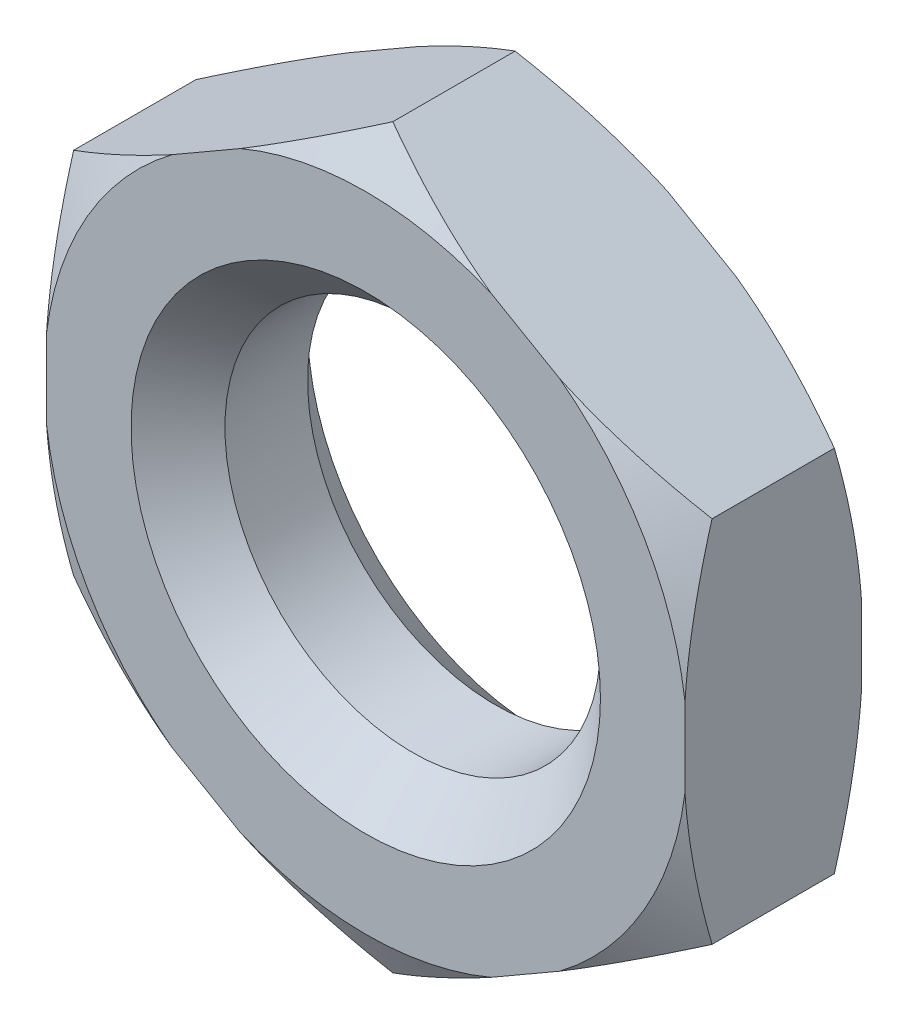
ISO-10303-21;
HEADER;
FILE_DESCRIPTION(('STEP AP214'),'2;1');
FILE_NAME('part.step','',(''),(''),'','','');
FILE_SCHEMA(('AUTOMOTIVE_DESIGN { 1 0 10303 214 1 1 1 1 }'));
ENDSEC;
DATA;
#1=APPLICATION_CONTEXT('core data for automotive mechanical design processes');
#2=APPLICATION_PROTOCOL_DEFINITION('international standard','automotive_design',2000,#1);
#3=PRODUCT_CONTEXT('',#1,'mechanical');
#4=PRODUCT('Part','Part','',(#3));
#5=PRODUCT_RELATED_PRODUCT_CATEGORY('part','',(#4));
#6=PRODUCT_DEFINITION_FORMATION('','',#4);
#7=PRODUCT_DEFINITION_CONTEXT('part definition',#1,'design');
#8=PRODUCT_DEFINITION('design','',#6,#7);
#9=PRODUCT_DEFINITION_SHAPE('','',#8);
#10=(LENGTH_UNIT() NAMED_UNIT(*) SI_UNIT(.MILLI.,.METRE.));
#11=(NAMED_UNIT(*) PLANE_ANGLE_UNIT() SI_UNIT($,.RADIAN.));
#12=(NAMED_UNIT(*) SI_UNIT($,.STERADIAN.) SOLID_ANGLE_UNIT());
#13=UNCERTAINTY_MEASURE_WITH_UNIT(LENGTH_MEASURE(1.E-05),#10,'distance_accuracy_value','');
#14=(GEOMETRIC_REPRESENTATION_CONTEXT(3) GLOBAL_UNCERTAINTY_ASSIGNED_CONTEXT((#13)) GLOBAL_UNIT_ASSIGNED_CONTEXT((#10,
#11,#12)) REPRESENTATION_CONTEXT('',''));
#15=CARTESIAN_POINT('',(0.,0.,0.));
#16=DIRECTION('',(0.,0.,1.));
#17=DIRECTION('',(1.,0.,0.));
#18=AXIS2_PLACEMENT_3D('',#15,#16,#17);
#19=CARTESIAN_POINT('',(8.49999999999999,4.90747728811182,2.35));
#20=DIRECTION('',(-0.5,-0.866025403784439,0.));
#21=DIRECTION('',(0.866025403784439,-0.5,0.));
#22=AXIS2_PLACEMENT_3D('',#19,#20,#21);
#23=PLANE('',#22);
#24=CARTESIAN_POINT('',(-5.90507087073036,13.2242488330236,1.06665217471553));
#25=CARTESIAN_POINT('',(-5.63799011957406,13.0700496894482,0.922520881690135));
#26=CARTESIAN_POINT('',(-5.37027055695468,12.9154817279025,0.779943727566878));
#27=CARTESIAN_POINT('',(-4.83328443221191,12.6054526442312,0.498627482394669));
#28=CARTESIAN_POINT('',(-4.5640176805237,12.4499914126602,0.359888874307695));
#29=CARTESIAN_POINT('',(-4.02286836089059,12.1375587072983,0.0865784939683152));
#30=CARTESIAN_POINT('',(-3.75098017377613,11.9805839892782,-0.0479784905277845));
#31=CARTESIAN_POINT('',(-3.20516765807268,11.6654589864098,-0.311456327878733));
#32=CARTESIAN_POINT('',(-2.93124339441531,11.5073087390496,-0.440377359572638));
#33=CARTESIAN_POINT('',(-2.37402843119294,11.1856005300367,-0.694544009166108));
#34=CARTESIAN_POINT('',(-2.09067683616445,11.0220074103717,-0.819612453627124));
#35=CARTESIAN_POINT('',(-1.52111624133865,10.6931714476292,-1.06084689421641));
#36=CARTESIAN_POINT('',(-1.23490710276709,10.5279285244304,-1.17701245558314));
#37=CARTESIAN_POINT('',(-0.65956429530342,10.1957541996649,-1.39823134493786));
#38=CARTESIAN_POINT('',(-0.370433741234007,10.028824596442,-1.50329536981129));
#39=CARTESIAN_POINT('',(0.211221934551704,9.69300553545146,-1.69988732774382));
#40=CARTESIAN_POINT('',(0.503746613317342,9.52411633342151,-1.79141700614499));
#41=CARTESIAN_POINT('',(1.20327585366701,9.12024293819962,-1.9893958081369));
#42=CARTESIAN_POINT('',(1.61190973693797,8.88431805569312,-2.0884843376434));
#43=CARTESIAN_POINT('',(2.22904112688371,8.52801708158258,-2.20761125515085));
#44=CARTESIAN_POINT('',(2.43543837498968,8.4088535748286,-2.24240162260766));
#45=CARTESIAN_POINT('',(2.84939185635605,8.16985742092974,-2.30127830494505));
#46=CARTESIAN_POINT('',(3.05694807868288,8.05002478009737,-2.32536472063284));
#47=CARTESIAN_POINT('',(3.47040435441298,7.81131568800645,-2.36192589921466));
#48=CARTESIAN_POINT('',(3.67629563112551,7.69244430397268,-2.37453232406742));
#49=CARTESIAN_POINT('',(4.08836628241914,7.45453520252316,-2.38823579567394));
#50=CARTESIAN_POINT('',(4.29454565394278,7.33549748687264,-2.3893329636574));
#51=CARTESIAN_POINT('',(4.7067055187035,7.09753687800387,-2.37998310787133));
#52=CARTESIAN_POINT('',(4.91268601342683,6.97861398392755,-2.36953617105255));
#53=CARTESIAN_POINT('',(5.32401108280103,6.74113534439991,-2.33741437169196));
#54=CARTESIAN_POINT('',(5.52935555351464,6.62257965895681,-2.31573776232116));
#55=CARTESIAN_POINT('',(6.0142832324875,6.34260653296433,-2.25183776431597));
#56=CARTESIAN_POINT('',(6.29341300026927,6.18145088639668,-2.20499080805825));
#57=CARTESIAN_POINT('',(6.8490051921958,5.86067958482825,-2.09361024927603));
#58=CARTESIAN_POINT('',(7.12546722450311,5.70106415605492,-2.02907408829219));
#59=CARTESIAN_POINT('',(7.67568842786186,5.3833937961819,-1.88475105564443));
#60=CARTESIAN_POINT('',(7.9494441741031,5.22534084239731,-1.80494695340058));
#61=CARTESIAN_POINT('',(8.4938845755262,4.91100803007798,-1.63260246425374));
#62=CARTESIAN_POINT('',(8.76456942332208,4.75472806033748,-1.54006288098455));
#63=CARTESIAN_POINT('',(9.30626543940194,4.44197971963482,-1.34327988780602));
#64=CARTESIAN_POINT('',(9.57724186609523,4.28553140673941,-1.23890985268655));
#65=CARTESIAN_POINT('',(10.1163237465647,3.97429233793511,-1.0213923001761));
#66=CARTESIAN_POINT('',(10.3844309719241,3.8195005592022,-0.908250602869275));
#67=CARTESIAN_POINT('',(10.9182012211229,3.51132816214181,-0.67474497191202));
#68=CARTESIAN_POINT('',(11.1838647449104,3.35794725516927,-0.554382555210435));
#69=CARTESIAN_POINT('',(11.7131077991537,3.05238863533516,-0.307698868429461));
#70=CARTESIAN_POINT('',(11.9766872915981,2.90021094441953,-0.18137748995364));
#71=CARTESIAN_POINT('',(12.4223414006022,2.64291242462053,0.0371216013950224));
#72=CARTESIAN_POINT('',(12.6048840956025,2.53752135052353,0.128031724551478));
#73=CARTESIAN_POINT('',(12.9691661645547,2.32720299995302,0.311953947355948));
#74=CARTESIAN_POINT('',(13.1509055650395,2.22227570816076,0.404965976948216));
#75=CARTESIAN_POINT('',(13.5117426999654,2.01394629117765,0.591848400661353));
#76=CARTESIAN_POINT('',(13.6908480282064,1.91053978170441,0.685699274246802));
#77=CARTESIAN_POINT('',(14.0484216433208,1.70409455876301,0.875015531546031));
#78=CARTESIAN_POINT('',(14.2268899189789,1.60105585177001,0.970480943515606));
#79=CARTESIAN_POINT('',(14.4050708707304,1.49818303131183,1.06665217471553));
#80=B_SPLINE_CURVE_WITH_KNOTS('',3,(#24,#25,#26,#27,#28,#29,#30,#31,#32,#33,#34,#35,#36,#37,#38,
#39,#40,#41,#42,#43,#44,#45,#46,#47,#48,#49,#50,#51,#52,#53,#54,#55,#56,#57,#58,#59,#60,#61,#62,
#63,#64,#65,#66,#67,#68,#69,#70,#71,#72,#73,#74,#75,#76,#77,#78,#79),.UNSPECIFIED.,.F.,.F.,(4,2,
2,2,2,2,2,2,2,2,2,2,2,2,2,2,2,2,2,2,2,2,2,2,2,2,2,4),(0.,1.0212601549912,2.04264822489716,
3.06731144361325,4.09194212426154,5.14266283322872,6.19343482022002,7.24318492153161,
8.29279953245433,9.73765676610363,10.4600162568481,11.1823689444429,11.8963287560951,
12.610281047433,13.3242279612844,14.0382859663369,15.0147893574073,15.991434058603,
16.9691875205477,17.9468793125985,18.9362523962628,19.9249745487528,20.9134897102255,
21.902022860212,22.5906653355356,23.2792848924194,23.9606121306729,24.6419513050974),.UNSPECIFIED.);
#81=CARTESIAN_POINT('',(0.,9.81495457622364,-1.62831216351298));
#82=VERTEX_POINT('',#81);
#83=CARTESIAN_POINT('',(3.33822416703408,7.8876299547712,-2.35));
#84=VERTEX_POINT('',#83);
#85=EDGE_CURVE('E168',#82,#84,#80,.T.);
#86=ORIENTED_EDGE('',*,*,#85,.F.);
#87=DIRECTION('',(0.,0.,-1.));
#88=VECTOR('',#87,1.);
#89=CARTESIAN_POINT('',(0.,9.81495457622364,2.35));
#90=LINE('',#89,#88);
#91=CARTESIAN_POINT('',(0.,9.81495457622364,1.62831216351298));
#92=VERTEX_POINT('',#91);
#93=EDGE_CURVE('E205',#92,#82,#90,.T.);
#94=ORIENTED_EDGE('',*,*,#93,.F.);
#95=CARTESIAN_POINT('',(14.4050708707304,1.49818303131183,-1.06665217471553));
#96=CARTESIAN_POINT('',(14.1379901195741,1.65238217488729,-0.922520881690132));
#97=CARTESIAN_POINT('',(13.8702705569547,1.80695013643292,-0.779943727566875));
#98=CARTESIAN_POINT('',(13.3332844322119,2.11697922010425,-0.498627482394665));
#99=CARTESIAN_POINT('',(13.0640176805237,2.27244045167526,-0.359888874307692));
#100=CARTESIAN_POINT('',(12.5228683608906,2.58487315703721,-0.0865784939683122));
#101=CARTESIAN_POINT('',(12.2509801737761,2.74184787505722,0.0479784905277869));
#102=CARTESIAN_POINT('',(11.7051676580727,3.05697287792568,0.311456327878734));
#103=CARTESIAN_POINT('',(11.4312433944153,3.21512312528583,0.44037735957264));
#104=CARTESIAN_POINT('',(10.8740284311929,3.53683133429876,0.69454400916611));
#105=CARTESIAN_POINT('',(10.5906768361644,3.70042445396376,0.819612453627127));
#106=CARTESIAN_POINT('',(10.0211162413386,4.02926041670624,1.06084689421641));
#107=CARTESIAN_POINT('',(9.73490710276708,4.19450333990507,1.17701245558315));
#108=CARTESIAN_POINT('',(9.15956429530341,4.52667766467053,1.39823134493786));
#109=CARTESIAN_POINT('',(8.870433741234,4.69360726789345,1.50329536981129));
#110=CARTESIAN_POINT('',(8.28877806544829,5.029426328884,1.69988732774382));
#111=CARTESIAN_POINT('',(7.99625338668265,5.19831553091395,1.79141700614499));
#112=CARTESIAN_POINT('',(7.29672414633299,5.60218892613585,1.9893958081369));
#113=CARTESIAN_POINT('',(6.88809026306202,5.83811380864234,2.0884843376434));
#114=CARTESIAN_POINT('',(6.27095887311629,6.19441478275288,2.20761125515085));
#115=CARTESIAN_POINT('',(6.06456162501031,6.31357828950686,2.24240162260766));
#116=CARTESIAN_POINT('',(5.65060814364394,6.55257444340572,2.30127830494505));
#117=CARTESIAN_POINT('',(5.44305192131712,6.67240708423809,2.32536472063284));
#118=CARTESIAN_POINT('',(5.02959564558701,6.91111617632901,2.36192589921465));
#119=CARTESIAN_POINT('',(4.82370436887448,7.02998756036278,2.37453232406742));
#120=CARTESIAN_POINT('',(4.41163371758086,7.2678966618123,2.38823579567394));
#121=CARTESIAN_POINT('',(4.20545434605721,7.38693437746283,2.3893329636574));
#122=CARTESIAN_POINT('',(3.79329448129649,7.62489498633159,2.37998310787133));
#123=CARTESIAN_POINT('',(3.58731398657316,7.74381788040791,2.36953617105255));
#124=CARTESIAN_POINT('',(3.17598891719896,7.98129651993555,2.33741437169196));
#125=CARTESIAN_POINT('',(2.97064444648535,8.09985220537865,2.31573776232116));
#126=CARTESIAN_POINT('',(2.4857167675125,8.37982533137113,2.25183776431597));
#127=CARTESIAN_POINT('',(2.20658699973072,8.54098097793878,2.20499080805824));
#128=CARTESIAN_POINT('',(1.65099480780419,8.86175227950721,2.09361024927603));
#129=CARTESIAN_POINT('',(1.37453277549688,9.02136770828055,2.02907408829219));
#130=CARTESIAN_POINT('',(0.824311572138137,9.33903806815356,1.88475105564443));
#131=CARTESIAN_POINT('',(0.550555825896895,9.49709102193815,1.80494695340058));
#132=CARTESIAN_POINT('',(0.00611542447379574,9.81142383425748,1.63260246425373));
#133=CARTESIAN_POINT('',(-0.264569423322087,9.96770380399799,1.54006288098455));
#134=CARTESIAN_POINT('',(-0.806265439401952,10.2804521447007,1.34327988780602));
#135=CARTESIAN_POINT('',(-1.07724186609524,10.4369004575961,1.23890985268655));
#136=CARTESIAN_POINT('',(-1.6163237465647,10.7481395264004,1.02139230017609));
#137=CARTESIAN_POINT('',(-1.88443097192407,10.9029313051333,0.90825060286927));
#138=CARTESIAN_POINT('',(-2.41820122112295,11.2111037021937,0.674744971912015));
#139=CARTESIAN_POINT('',(-2.68386474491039,11.3644846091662,0.55438255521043));
#140=CARTESIAN_POINT('',(-3.21310779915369,11.6700432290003,0.307698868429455));
#141=CARTESIAN_POINT('',(-3.47668729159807,11.8222209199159,0.181377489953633));
#142=CARTESIAN_POINT('',(-3.92234140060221,12.0795194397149,-0.0371216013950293));
#143=CARTESIAN_POINT('',(-4.10488409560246,12.1849105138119,-0.128031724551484));
#144=CARTESIAN_POINT('',(-4.46916616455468,12.3952288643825,-0.311953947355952));
#145=CARTESIAN_POINT('',(-4.65090556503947,12.5001561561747,-0.40496597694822));
#146=CARTESIAN_POINT('',(-5.01174269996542,12.7084855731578,-0.591848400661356));
#147=CARTESIAN_POINT('',(-5.19084802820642,12.8118920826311,-0.685699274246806));
#148=CARTESIAN_POINT('',(-5.5484216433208,13.0183373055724,-0.875015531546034));
#149=CARTESIAN_POINT('',(-5.72688991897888,13.1213760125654,-0.970480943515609));
#150=CARTESIAN_POINT('',(-5.90507087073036,13.2242488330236,-1.06665217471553));
#151=B_SPLINE_CURVE_WITH_KNOTS('',3,(#95,#96,#97,#98,#99,#100,#101,#102,#103,#104,#105,#106,
#107,#108,#109,#110,#111,#112,#113,#114,#115,#116,#117,#118,#119,#120,#121,#122,#123,#124,#125,
#126,#127,#128,#129,#130,#131,#132,#133,#134,#135,#136,#137,#138,#139,#140,#141,#142,#143,#144,
#145,#146,#147,#148,#149,#150),.UNSPECIFIED.,.F.,.F.,(4,2,2,2,2,2,2,2,2,2,2,2,2,2,2,2,2,2,2,2,2,
2,2,2,2,2,2,4),(0.,1.0212601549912,2.04264822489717,3.06731144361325,4.09194212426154,
5.14266283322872,6.19343482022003,7.24318492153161,8.29279953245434,9.73765676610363,
10.4600162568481,11.1823689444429,11.8963287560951,12.610281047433,13.3242279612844,
14.038285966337,15.0147893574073,15.991434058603,16.9691875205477,17.9468793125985,
18.9362523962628,19.9249745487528,20.9134897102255,21.902022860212,22.5906653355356,
23.2792848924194,23.9606121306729,24.6419513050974),.UNSPECIFIED.);
#152=CARTESIAN_POINT('',(3.33822416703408,7.8876299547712,2.35));
#153=VERTEX_POINT('',#152);
#154=EDGE_CURVE('E337',#153,#92,#151,.T.);
#155=ORIENTED_EDGE('',*,*,#154,.F.);
#156=DIRECTION('',(-0.866025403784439,0.5,0.));
#157=VECTOR('',#156,1.);
#158=CARTESIAN_POINT('',(8.49999999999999,4.90747728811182,2.35));
#159=LINE('',#158,#157);
#160=CARTESIAN_POINT('',(5.16177583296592,6.83480190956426,2.35));
#161=VERTEX_POINT('',#160);
#162=EDGE_CURVE('E321',#161,#153,#159,.T.);
#163=ORIENTED_EDGE('',*,*,#162,.F.);
#164=CARTESIAN_POINT('',(8.49999999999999,4.90747728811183,1.62831216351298));
#165=VERTEX_POINT('',#164);
#166=EDGE_CURVE('E184',#165,#161,#151,.T.);
#167=ORIENTED_EDGE('',*,*,#166,.F.);
#168=DIRECTION('',(0.,0.,-1.));
#169=VECTOR('',#168,1.);
#170=CARTESIAN_POINT('',(8.49999999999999,4.90747728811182,2.35));
#171=LINE('',#170,#169);
#172=CARTESIAN_POINT('',(8.49999999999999,4.90747728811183,-1.62831216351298));
#173=VERTEX_POINT('',#172);
#174=EDGE_CURVE('E174',#165,#173,#171,.T.);
#175=ORIENTED_EDGE('',*,*,#174,.T.);
#176=CARTESIAN_POINT('',(5.16177583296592,6.83480190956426,-2.35));
#177=VERTEX_POINT('',#176);
#178=EDGE_CURVE('E156',#177,#173,#80,.T.);
#179=ORIENTED_EDGE('',*,*,#178,.F.);
#180=DIRECTION('',(-0.866025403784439,0.5,0.));
#181=VECTOR('',#180,1.);
#182=CARTESIAN_POINT('',(8.49999999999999,4.90747728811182,-2.35));
#183=LINE('',#182,#181);
#184=EDGE_CURVE('E240',#177,#84,#183,.T.);
#185=ORIENTED_EDGE('',*,*,#184,.T.);
#186=EDGE_LOOP('',(#86,#94,#155,#163,#167,#175,#179,#185));
#187=FACE_BOUND('',#186,.T.);
#188=ADVANCED_FACE('F32',(#187),#23,.F.);
#189=CARTESIAN_POINT('',(0.,9.81495457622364,2.35));
#190=DIRECTION('',(0.5,-0.866025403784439,0.));
#191=DIRECTION('',(0.866025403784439,0.5,0.));
#192=AXIS2_PLACEMENT_3D('',#189,#190,#191);
#193=PLANE('',#192);
#194=CARTESIAN_POINT('',(-14.4050708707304,1.49818303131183,1.06665217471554));
#195=CARTESIAN_POINT('',(-14.1379901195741,1.65238217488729,0.92252088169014));
#196=CARTESIAN_POINT('',(-13.8702705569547,1.80695013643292,0.779943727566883));
#197=CARTESIAN_POINT('',(-13.3332844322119,2.11697922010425,0.498627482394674));
#198=CARTESIAN_POINT('',(-13.0640176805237,2.27244045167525,0.359888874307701));
#199=CARTESIAN_POINT('',(-12.5228683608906,2.58487315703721,0.0865784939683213));
#200=CARTESIAN_POINT('',(-12.2509801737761,2.74184787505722,-0.0479784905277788));
#201=CARTESIAN_POINT('',(-11.7051676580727,3.05697287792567,-0.311456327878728));
#202=CARTESIAN_POINT('',(-11.4312433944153,3.21512312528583,-0.440377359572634));
#203=CARTESIAN_POINT('',(-10.8740284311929,3.53683133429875,-0.694544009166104));
#204=CARTESIAN_POINT('',(-10.5906768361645,3.70042445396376,-0.81961245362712));
#205=CARTESIAN_POINT('',(-10.0211162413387,4.02926041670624,-1.0608468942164));
#206=CARTESIAN_POINT('',(-9.7349071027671,4.19450333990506,-1.17701245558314));
#207=CARTESIAN_POINT('',(-9.15956429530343,4.52667766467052,-1.39823134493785));
#208=CARTESIAN_POINT('',(-8.87043374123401,4.69360726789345,-1.50329536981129));
#209=CARTESIAN_POINT('',(-8.2887780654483,5.029426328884,-1.69988732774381));
#210=CARTESIAN_POINT('',(-7.99625338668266,5.19831553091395,-1.79141700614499));
#211=CARTESIAN_POINT('',(-7.296724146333,5.60218892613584,-1.9893958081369));
#212=CARTESIAN_POINT('',(-6.88809026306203,5.83811380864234,-2.0884843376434));
#213=CARTESIAN_POINT('',(-6.2709588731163,6.19441478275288,-2.20761125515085));
#214=CARTESIAN_POINT('',(-6.06456162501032,6.31357828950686,-2.24240162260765));
#215=CARTESIAN_POINT('',(-5.65060814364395,6.55257444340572,-2.30127830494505));
#216=CARTESIAN_POINT('',(-5.44305192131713,6.67240708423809,-2.32536472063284));
#217=CARTESIAN_POINT('',(-5.02959564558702,6.911116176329,-2.36192589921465));
#218=CARTESIAN_POINT('',(-4.82370436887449,7.02998756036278,-2.37453232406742));
#219=CARTESIAN_POINT('',(-4.41163371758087,7.2678966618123,-2.38823579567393));
#220=CARTESIAN_POINT('',(-4.20545434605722,7.38693437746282,-2.3893329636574));
#221=CARTESIAN_POINT('',(-3.7932944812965,7.62489498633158,-2.37998310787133));
#222=CARTESIAN_POINT('',(-3.58731398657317,7.74381788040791,-2.36953617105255));
#223=CARTESIAN_POINT('',(-3.17598891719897,7.98129651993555,-2.33741437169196));
#224=CARTESIAN_POINT('',(-2.97064444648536,8.09985220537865,-2.31573776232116));
#225=CARTESIAN_POINT('',(-2.48571676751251,8.37982533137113,-2.25183776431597));
#226=CARTESIAN_POINT('',(-2.20658699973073,8.54098097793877,-2.20499080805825));
#227=CARTESIAN_POINT('',(-1.6509948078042,8.86175227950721,-2.09361024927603));
#228=CARTESIAN_POINT('',(-1.37453277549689,9.02136770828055,-2.02907408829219));
#229=CARTESIAN_POINT('',(-0.824311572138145,9.33903806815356,-1.88475105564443));
#230=CARTESIAN_POINT('',(-0.550555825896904,9.49709102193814,-1.80494695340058));
#231=CARTESIAN_POINT('',(-0.00611542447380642,9.81142383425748,-1.63260246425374));
#232=CARTESIAN_POINT('',(0.264569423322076,9.96770380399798,-1.54006288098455));
#233=CARTESIAN_POINT('',(0.80626543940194,10.2804521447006,-1.34327988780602));
#234=CARTESIAN_POINT('',(1.07724186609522,10.436900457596,-1.23890985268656));
#235=CARTESIAN_POINT('',(1.61632374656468,10.7481395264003,-1.0213923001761));
#236=CARTESIAN_POINT('',(1.88443097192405,10.9029313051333,-0.908250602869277));
#237=CARTESIAN_POINT('',(2.41820122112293,11.2111037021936,-0.674744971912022));
#238=CARTESIAN_POINT('',(2.68386474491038,11.3644846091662,-0.554382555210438));
#239=CARTESIAN_POINT('',(3.21310779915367,11.6700432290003,-0.307698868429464));
#240=CARTESIAN_POINT('',(3.47668729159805,11.8222209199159,-0.181377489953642));
#241=CARTESIAN_POINT('',(3.9223414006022,12.0795194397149,0.0371216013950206));
#242=CARTESIAN_POINT('',(4.10488409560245,12.1849105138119,0.128031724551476));
#243=CARTESIAN_POINT('',(4.46916616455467,12.3952288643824,0.311953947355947));
#244=CARTESIAN_POINT('',(4.65090556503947,12.5001561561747,0.404965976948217));
#245=CARTESIAN_POINT('',(5.01174269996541,12.7084855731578,0.591848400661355));
#246=CARTESIAN_POINT('',(5.19084802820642,12.8118920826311,0.685699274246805));
#247=CARTESIAN_POINT('',(5.54842164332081,13.0183373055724,0.875015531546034));
#248=CARTESIAN_POINT('',(5.72688991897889,13.1213760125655,0.97048094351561));
#249=CARTESIAN_POINT('',(5.90507087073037,13.2242488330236,1.06665217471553));
#250=B_SPLINE_CURVE_WITH_KNOTS('',3,(#194,#195,#196,#197,#198,#199,#200,#201,#202,#203,#204,
#205,#206,#207,#208,#209,#210,#211,#212,#213,#214,#215,#216,#217,#218,#219,#220,#221,#222,#223,
#224,#225,#226,#227,#228,#229,#230,#231,#232,#233,#234,#235,#236,#237,#238,#239,#240,#241,#242,
#243,#244,#245,#246,#247,#248,#249),.UNSPECIFIED.,.F.,.F.,(4,2,2,2,2,2,2,2,2,2,2,2,2,2,2,2,2,2,
2,2,2,2,2,2,2,2,2,4),(0.,1.0212601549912,2.04264822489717,3.06731144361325,4.09194212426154,
5.14266283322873,6.19343482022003,7.24318492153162,8.29279953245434,9.73765676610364,
10.4600162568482,11.1823689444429,11.8963287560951,12.610281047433,13.3242279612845,
14.038285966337,15.0147893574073,15.991434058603,16.9691875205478,17.9468793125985,
18.9362523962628,19.9249745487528,20.9134897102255,21.902022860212,22.5906653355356,
23.2792848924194,23.9606121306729,24.6419513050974),.UNSPECIFIED.);
#251=CARTESIAN_POINT('',(-8.5,4.90747728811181,-1.62831216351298));
#252=VERTEX_POINT('',#251);
#253=CARTESIAN_POINT('',(-5.16177583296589,6.83480190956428,-2.35));
#254=VERTEX_POINT('',#253);
#255=EDGE_CURVE('E47',#252,#254,#250,.T.);
#256=ORIENTED_EDGE('',*,*,#255,.F.);
#257=DIRECTION('',(0.,0.,-1.));
#258=VECTOR('',#257,1.);
#259=CARTESIAN_POINT('',(-8.5,4.90747728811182,2.35));
#260=LINE('',#259,#258);
#261=CARTESIAN_POINT('',(-8.5,4.90747728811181,1.62831216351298));
#262=VERTEX_POINT('',#261);
#263=EDGE_CURVE('E202',#262,#252,#260,.T.);
#264=ORIENTED_EDGE('',*,*,#263,.F.);
#265=CARTESIAN_POINT('',(5.90507087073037,13.2242488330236,-1.06665217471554));
#266=CARTESIAN_POINT('',(5.63799011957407,13.0700496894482,-0.922520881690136));
#267=CARTESIAN_POINT('',(5.37027055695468,12.9154817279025,-0.779943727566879));
#268=CARTESIAN_POINT('',(4.83328443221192,12.6054526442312,-0.49862748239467));
#269=CARTESIAN_POINT('',(4.56401768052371,12.4499914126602,-0.359888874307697));
#270=CARTESIAN_POINT('',(4.0228683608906,12.1375587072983,-0.0865784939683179));
#271=CARTESIAN_POINT('',(3.75098017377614,11.9805839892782,0.0479784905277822));
#272=CARTESIAN_POINT('',(3.20516765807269,11.6654589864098,0.311456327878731));
#273=CARTESIAN_POINT('',(2.93124339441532,11.5073087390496,0.440377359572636));
#274=CARTESIAN_POINT('',(2.37402843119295,11.1856005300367,0.694544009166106));
#275=CARTESIAN_POINT('',(2.09067683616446,11.0220074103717,0.819612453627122));
#276=CARTESIAN_POINT('',(1.52111624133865,10.6931714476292,1.06084689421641));
#277=CARTESIAN_POINT('',(1.23490710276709,10.5279285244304,1.17701245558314));
#278=CARTESIAN_POINT('',(0.659564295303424,10.1957541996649,1.39823134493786));
#279=CARTESIAN_POINT('',(0.37043374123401,10.028824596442,1.50329536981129));
#280=CARTESIAN_POINT('',(-0.211221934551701,9.69300553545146,1.69988732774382));
#281=CARTESIAN_POINT('',(-0.503746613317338,9.52411633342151,1.79141700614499));
#282=CARTESIAN_POINT('',(-1.203275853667,9.12024293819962,1.9893958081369));
#283=CARTESIAN_POINT('',(-1.61190973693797,8.88431805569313,2.0884843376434));
#284=CARTESIAN_POINT('',(-2.22904112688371,8.52801708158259,2.20761125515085));
#285=CARTESIAN_POINT('',(-2.43543837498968,8.4088535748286,2.24240162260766));
#286=CARTESIAN_POINT('',(-2.84939185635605,8.16985742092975,2.30127830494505));
#287=CARTESIAN_POINT('',(-3.05694807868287,8.05002478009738,2.32536472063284));
#288=CARTESIAN_POINT('',(-3.47040435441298,7.81131568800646,2.36192589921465));
#289=CARTESIAN_POINT('',(-3.67629563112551,7.69244430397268,2.37453232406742));
#290=CARTESIAN_POINT('',(-4.08836628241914,7.45453520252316,2.38823579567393));
#291=CARTESIAN_POINT('',(-4.29454565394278,7.33549748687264,2.3893329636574));
#292=CARTESIAN_POINT('',(-4.7067055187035,7.09753687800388,2.37998310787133));
#293=CARTESIAN_POINT('',(-4.91268601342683,6.97861398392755,2.36953617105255));
#294=CARTESIAN_POINT('',(-5.32401108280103,6.74113534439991,2.33741437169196));
#295=CARTESIAN_POINT('',(-5.52935555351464,6.62257965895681,2.31573776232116));
#296=CARTESIAN_POINT('',(-6.0142832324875,6.34260653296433,2.25183776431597));
#297=CARTESIAN_POINT('',(-6.29341300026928,6.18145088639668,2.20499080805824));
#298=CARTESIAN_POINT('',(-6.84900519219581,5.86067958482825,2.09361024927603));
#299=CARTESIAN_POINT('',(-7.12546722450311,5.70106415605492,2.02907408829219));
#300=CARTESIAN_POINT('',(-7.67568842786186,5.3833937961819,1.88475105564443));
#301=CARTESIAN_POINT('',(-7.9494441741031,5.22534084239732,1.80494695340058));
#302=CARTESIAN_POINT('',(-8.4938845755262,4.91100803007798,1.63260246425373));
#303=CARTESIAN_POINT('',(-8.76456942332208,4.75472806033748,1.54006288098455));
#304=CARTESIAN_POINT('',(-9.30626543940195,4.44197971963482,1.34327988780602));
#305=CARTESIAN_POINT('',(-9.57724186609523,4.28553140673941,1.23890985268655));
#306=CARTESIAN_POINT('',(-10.1163237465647,3.97429233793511,1.02139230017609));
#307=CARTESIAN_POINT('',(-10.3844309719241,3.8195005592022,0.908250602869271));
#308=CARTESIAN_POINT('',(-10.9182012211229,3.51132816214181,0.674744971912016));
#309=CARTESIAN_POINT('',(-11.1838647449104,3.35794725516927,0.554382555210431));
#310=CARTESIAN_POINT('',(-11.7131077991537,3.05238863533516,0.307698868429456));
#311=CARTESIAN_POINT('',(-11.9766872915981,2.90021094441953,0.181377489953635));
#312=CARTESIAN_POINT('',(-12.4223414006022,2.64291242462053,-0.0371216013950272));
#313=CARTESIAN_POINT('',(-12.6048840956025,2.53752135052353,-0.128031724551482));
#314=CARTESIAN_POINT('',(-12.9691661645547,2.32720299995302,-0.311953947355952));
#315=CARTESIAN_POINT('',(-13.1509055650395,2.22227570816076,-0.404965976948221));
#316=CARTESIAN_POINT('',(-13.5117426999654,2.01394629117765,-0.591848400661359));
#317=CARTESIAN_POINT('',(-13.6908480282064,1.91053978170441,-0.685699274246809));
#318=CARTESIAN_POINT('',(-14.0484216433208,1.70409455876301,-0.875015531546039));
#319=CARTESIAN_POINT('',(-14.2268899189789,1.60105585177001,-0.970480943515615));
#320=CARTESIAN_POINT('',(-14.4050708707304,1.49818303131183,-1.06665217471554));
#321=B_SPLINE_CURVE_WITH_KNOTS('',3,(#265,#266,#267,#268,#269,#270,#271,#272,#273,#274,#275,
#276,#277,#278,#279,#280,#281,#282,#283,#284,#285,#286,#287,#288,#289,#290,#291,#292,#293,#294,
#295,#296,#297,#298,#299,#300,#301,#302,#303,#304,#305,#306,#307,#308,#309,#310,#311,#312,#313,
#314,#315,#316,#317,#318,#319,#320),.UNSPECIFIED.,.F.,.F.,(4,2,2,2,2,2,2,2,2,2,2,2,2,2,2,2,2,2,
2,2,2,2,2,2,2,2,2,4),(0.,1.0212601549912,2.04264822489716,3.06731144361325,4.09194212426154,
5.14266283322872,6.19343482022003,7.24318492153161,8.29279953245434,9.73765676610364,
10.4600162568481,11.1823689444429,11.8963287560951,12.610281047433,13.3242279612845,
14.038285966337,15.0147893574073,15.991434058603,16.9691875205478,17.9468793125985,
18.9362523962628,19.9249745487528,20.9134897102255,21.902022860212,22.5906653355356,
23.2792848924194,23.9606121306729,24.6419513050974),.UNSPECIFIED.);
#322=CARTESIAN_POINT('',(-5.16177583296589,6.83480190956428,2.35));
#323=VERTEX_POINT('',#322);
#324=EDGE_CURVE('E315',#323,#262,#321,.T.);
#325=ORIENTED_EDGE('',*,*,#324,.F.);
#326=DIRECTION('',(-0.866025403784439,-0.5,0.));
#327=VECTOR('',#326,1.);
#328=CARTESIAN_POINT('',(0.,9.81495457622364,2.35));
#329=LINE('',#328,#327);
#330=CARTESIAN_POINT('',(-3.33822416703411,7.88762995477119,2.35));
#331=VERTEX_POINT('',#330);
#332=EDGE_CURVE('E324',#331,#323,#329,.T.);
#333=ORIENTED_EDGE('',*,*,#332,.F.);
#334=EDGE_CURVE('E320',#92,#331,#321,.T.);
#335=ORIENTED_EDGE('',*,*,#334,.F.);
#336=ORIENTED_EDGE('',*,*,#93,.T.);
#337=CARTESIAN_POINT('',(-3.33822416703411,7.88762995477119,-2.35));
#338=VERTEX_POINT('',#337);
#339=EDGE_CURVE('E581',#338,#82,#250,.T.);
#340=ORIENTED_EDGE('',*,*,#339,.F.);
#341=DIRECTION('',(-0.866025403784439,-0.5,0.));
#342=VECTOR('',#341,1.);
#343=CARTESIAN_POINT('',(0.,9.81495457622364,-2.35));
#344=LINE('',#343,#342);
#345=EDGE_CURVE('E336',#338,#254,#344,.T.);
#346=ORIENTED_EDGE('',*,*,#345,.T.);
#347=EDGE_LOOP('',(#256,#264,#325,#333,#335,#336,#340,#346));
#348=FACE_BOUND('',#347,.T.);
#349=ADVANCED_FACE('F296',(#348),#193,.F.);
#350=CARTESIAN_POINT('',(-8.5,4.90747728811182,2.35));
#351=DIRECTION('',(1.,0.,0.));
#352=DIRECTION('',(0.,0.,-1.));
#353=AXIS2_PLACEMENT_3D('',#350,#351,#352);
#354=PLANE('',#353);
#355=CARTESIAN_POINT('',(-8.5,-10.8125481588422,0.645659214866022));
#356=CARTESIAN_POINT('',(-8.5,-10.5054486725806,0.506306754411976));
#357=CARTESIAN_POINT('',(-8.5,-10.1975094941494,0.368769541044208));
#358=CARTESIAN_POINT('',(-8.5,-9.57959204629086,0.0982063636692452));
#359=CARTESIAN_POINT('',(-8.5,-9.26961341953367,-0.0348187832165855));
#360=CARTESIAN_POINT('',(-8.5,-8.64606936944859,-0.295970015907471));
#361=CARTESIAN_POINT('',(-8.5,-8.33249437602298,-0.424073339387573));
#362=CARTESIAN_POINT('',(-8.5,-7.70269446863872,-0.673574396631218));
#363=CARTESIAN_POINT('',(-8.5,-7.38646967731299,-0.794972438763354));
#364=CARTESIAN_POINT('',(-8.5,-6.75239517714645,-1.02904749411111));
#365=CARTESIAN_POINT('',(-8.5,-6.4345589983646,-1.14176097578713));
#366=CARTESIAN_POINT('',(-8.5,-5.79548991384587,-1.35723454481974));
#367=CARTESIAN_POINT('',(-8.5,-5.47425684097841,-1.45999413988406));
#368=CARTESIAN_POINT('',(-8.5,-4.82856101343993,-1.65320358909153));
#369=CARTESIAN_POINT('',(-8.5,-4.50410327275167,-1.74367007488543));
#370=CARTESIAN_POINT('',(-8.5,-3.85140158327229,-1.90988870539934));
#371=CARTESIAN_POINT('',(-8.5,-3.52315779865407,-1.98564148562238));
#372=CARTESIAN_POINT('',(-8.5,-2.95653291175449,-2.10068600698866));
#373=CARTESIAN_POINT('',(-8.5,-2.7190145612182,-2.1442289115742));
#374=CARTESIAN_POINT('',(-8.5,-2.24238579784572,-2.22132178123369));
#375=CARTESIAN_POINT('',(-8.5,-2.0032756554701,-2.25487340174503));
#376=CARTESIAN_POINT('',(-8.5,-1.52381534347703,-2.31110682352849));
#377=CARTESIAN_POINT('',(-8.5,-1.2834654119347,-2.33379063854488));
#378=CARTESIAN_POINT('',(-8.5,-0.801948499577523,-2.36763913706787));
#379=CARTESIAN_POINT('',(-8.5,-0.560781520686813,-2.378803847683));
#380=CARTESIAN_POINT('',(-8.5,-0.0783124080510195,-2.38926599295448));
#381=CARTESIAN_POINT('',(-8.5,0.162989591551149,-2.38856955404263));
#382=CARTESIAN_POINT('',(-8.5,0.645264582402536,-2.37534660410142));
#383=CARTESIAN_POINT('',(-8.5,0.886237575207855,-2.36282014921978));
#384=CARTESIAN_POINT('',(-8.5,1.36733301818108,-2.32631969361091));
#385=CARTESIAN_POINT('',(-8.5,1.60745537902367,-2.3023445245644));
#386=CARTESIAN_POINT('',(-8.5,2.08637470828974,-2.24363681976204));
#387=CARTESIAN_POINT('',(-8.5,2.32517162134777,-2.20890383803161));
#388=CARTESIAN_POINT('',(-8.5,2.92025772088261,-2.10970931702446));
#389=CARTESIAN_POINT('',(-8.5,3.27552188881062,-2.03906972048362));
#390=CARTESIAN_POINT('',(-8.5,3.98178756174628,-1.87898494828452));
#391=CARTESIAN_POINT('',(-8.5,4.33278809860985,-1.78953558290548));
#392=CARTESIAN_POINT('',(-8.5,5.03122358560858,-1.59499609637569));
#393=CARTESIAN_POINT('',(-8.5,5.37864891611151,-1.48987177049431));
#394=CARTESIAN_POINT('',(-8.5,6.06940187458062,-1.26711124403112));
#395=CARTESIAN_POINT('',(-8.5,6.41272978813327,-1.14947592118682));
#396=CARTESIAN_POINT('',(-8.5,7.09967269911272,-0.902738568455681));
#397=CARTESIAN_POINT('',(-8.5,7.44324570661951,-0.773520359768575));
#398=CARTESIAN_POINT('',(-8.5,8.12717672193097,-0.506816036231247));
#399=CARTESIAN_POINT('',(-8.5,8.46753452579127,-0.369329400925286));
#400=CARTESIAN_POINT('',(-8.5,9.14336614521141,-0.0885863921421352));
#401=CARTESIAN_POINT('',(-8.5,9.47885717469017,0.0546287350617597));
#402=CARTESIAN_POINT('',(-8.5,10.1474074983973,0.346413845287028));
#403=CARTESIAN_POINT('',(-8.5,10.4804673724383,0.494982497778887));
#404=CARTESIAN_POINT('',(-8.5,10.8125481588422,0.645659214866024));
#405=B_SPLINE_CURVE_WITH_KNOTS('',3,(#355,#356,#357,#358,#359,#360,#361,#362,#363,#364,#365,
#366,#367,#368,#369,#370,#371,#372,#373,#374,#375,#376,#377,#378,#379,#380,#381,#382,#383,#384,
#385,#386,#387,#388,#389,#390,#391,#392,#393,#394,#395,#396,#397,#398,#399,#400,#401,#402,#403,
#404),.UNSPECIFIED.,.F.,.F.,(4,2,2,2,2,2,2,2,2,2,2,2,2,2,2,2,2,2,2,2,2,2,2,2,4),(0.,
1.01172864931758,2.02363955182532,3.03977350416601,4.05586068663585,5.06741778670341,
6.07902489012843,7.08924944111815,8.09943034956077,8.82367557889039,9.54780074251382,
10.2717916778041,10.9957809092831,11.7193962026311,12.4430080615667,13.1666937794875,
13.890409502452,14.9764117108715,16.0626560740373,17.1513064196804,18.2398804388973,
19.3409567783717,20.4421024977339,21.5363932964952,22.6304139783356),.UNSPECIFIED.);
#406=CARTESIAN_POINT('',(-8.5,-4.90747728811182,-1.62831216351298));
#407=VERTEX_POINT('',#406);
#408=CARTESIAN_POINT('',(-8.5,-1.0528280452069,-2.35));
#409=VERTEX_POINT('',#408);
#410=EDGE_CURVE('E55',#407,#409,#405,.T.);
#411=ORIENTED_EDGE('',*,*,#410,.F.);
#412=DIRECTION('',(0.,0.,-1.));
#413=VECTOR('',#412,1.);
#414=CARTESIAN_POINT('',(-8.5,-4.90747728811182,2.35));
#415=LINE('',#414,#413);
#416=CARTESIAN_POINT('',(-8.5,-4.90747728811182,1.62831216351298));
#417=VERTEX_POINT('',#416);
#418=EDGE_CURVE('E199',#417,#407,#415,.T.);
#419=ORIENTED_EDGE('',*,*,#418,.F.);
#420=CARTESIAN_POINT('',(-8.5,10.8125481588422,-0.645659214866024));
#421=CARTESIAN_POINT('',(-8.5,10.5054486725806,-0.506306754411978));
#422=CARTESIAN_POINT('',(-8.5,10.1975094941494,-0.36876954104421));
#423=CARTESIAN_POINT('',(-8.5,9.57959204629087,-0.098206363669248));
#424=CARTESIAN_POINT('',(-8.5,9.26961341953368,0.0348187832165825));
#425=CARTESIAN_POINT('',(-8.5,8.6460693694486,0.295970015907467));
#426=CARTESIAN_POINT('',(-8.5,8.33249437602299,0.42407333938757));
#427=CARTESIAN_POINT('',(-8.5,7.70269446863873,0.673574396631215));
#428=CARTESIAN_POINT('',(-8.5,7.386469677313,0.794972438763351));
#429=CARTESIAN_POINT('',(-8.5,6.75239517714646,1.02904749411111));
#430=CARTESIAN_POINT('',(-8.5,6.43455899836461,1.14176097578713));
#431=CARTESIAN_POINT('',(-8.5,5.79548991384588,1.35723454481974));
#432=CARTESIAN_POINT('',(-8.5,5.47425684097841,1.45999413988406));
#433=CARTESIAN_POINT('',(-8.5,4.82856101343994,1.65320358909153));
#434=CARTESIAN_POINT('',(-8.5,4.50410327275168,1.74367007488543));
#435=CARTESIAN_POINT('',(-8.5,3.85140158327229,1.90988870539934));
#436=CARTESIAN_POINT('',(-8.5,3.52315779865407,1.98564148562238));
#437=CARTESIAN_POINT('',(-8.5,2.9565329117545,2.10068600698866));
#438=CARTESIAN_POINT('',(-8.5,2.7190145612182,2.1442289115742));
#439=CARTESIAN_POINT('',(-8.5,2.24238579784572,2.22132178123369));
#440=CARTESIAN_POINT('',(-8.5,2.0032756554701,2.25487340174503));
#441=CARTESIAN_POINT('',(-8.5,1.52381534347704,2.31110682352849));
#442=CARTESIAN_POINT('',(-8.5,1.28346541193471,2.33379063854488));
#443=CARTESIAN_POINT('',(-8.5,0.801948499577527,2.36763913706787));
#444=CARTESIAN_POINT('',(-8.5,0.560781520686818,2.378803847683));
#445=CARTESIAN_POINT('',(-8.5,0.0783124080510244,2.38926599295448));
#446=CARTESIAN_POINT('',(-8.5,-0.162989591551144,2.38856955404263));
#447=CARTESIAN_POINT('',(-8.5,-0.645264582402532,2.37534660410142));
#448=CARTESIAN_POINT('',(-8.5,-0.88623757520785,2.36282014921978));
#449=CARTESIAN_POINT('',(-8.5,-1.36733301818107,2.32631969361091));
#450=CARTESIAN_POINT('',(-8.5,-1.60745537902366,2.3023445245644));
#451=CARTESIAN_POINT('',(-8.5,-2.08637470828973,2.24363681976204));
#452=CARTESIAN_POINT('',(-8.5,-2.32517162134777,2.20890383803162));
#453=CARTESIAN_POINT('',(-8.5,-2.9202577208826,2.10970931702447));
#454=CARTESIAN_POINT('',(-8.5,-3.27552188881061,2.03906972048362));
#455=CARTESIAN_POINT('',(-8.5,-3.98178756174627,1.87898494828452));
#456=CARTESIAN_POINT('',(-8.5,-4.33278809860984,1.78953558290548));
#457=CARTESIAN_POINT('',(-8.5,-5.03122358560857,1.59499609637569));
#458=CARTESIAN_POINT('',(-8.5,-5.37864891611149,1.48987177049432));
#459=CARTESIAN_POINT('',(-8.5,-6.06940187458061,1.26711124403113));
#460=CARTESIAN_POINT('',(-8.5,-6.41272978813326,1.14947592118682));
#461=CARTESIAN_POINT('',(-8.5,-7.09967269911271,0.902738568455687));
#462=CARTESIAN_POINT('',(-8.5,-7.4432457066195,0.77352035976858));
#463=CARTESIAN_POINT('',(-8.5,-8.12717672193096,0.506816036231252));
#464=CARTESIAN_POINT('',(-8.5,-8.46753452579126,0.369329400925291));
#465=CARTESIAN_POINT('',(-8.5,-9.1433661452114,0.0885863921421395));
#466=CARTESIAN_POINT('',(-8.5,-9.47885717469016,-0.0546287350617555));
#467=CARTESIAN_POINT('',(-8.5,-10.1474074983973,-0.346413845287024));
#468=CARTESIAN_POINT('',(-8.5,-10.4804673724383,-0.494982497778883));
#469=CARTESIAN_POINT('',(-8.5,-10.8125481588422,-0.64565921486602));
#470=B_SPLINE_CURVE_WITH_KNOTS('',3,(#420,#421,#422,#423,#424,#425,#426,#427,#428,#429,#430,
#431,#432,#433,#434,#435,#436,#437,#438,#439,#440,#441,#442,#443,#444,#445,#446,#447,#448,#449,
#450,#451,#452,#453,#454,#455,#456,#457,#458,#459,#460,#461,#462,#463,#464,#465,#466,#467,#468,
#469),.UNSPECIFIED.,.F.,.F.,(4,2,2,2,2,2,2,2,2,2,2,2,2,2,2,2,2,2,2,2,2,2,2,2,4),(0.,
1.01172864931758,2.02363955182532,3.039773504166,4.05586068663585,5.0674177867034,
6.07902489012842,7.08924944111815,8.09943034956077,8.8236755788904,9.54780074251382,
10.2717916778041,10.9957809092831,11.7193962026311,12.4430080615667,13.1666937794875,
13.890409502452,14.9764117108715,16.0626560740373,17.1513064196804,18.2398804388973,
19.3409567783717,20.4421024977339,21.5363932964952,22.6304139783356),.UNSPECIFIED.);
#471=CARTESIAN_POINT('',(-8.5,-1.0528280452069,2.35));
#472=VERTEX_POINT('',#471);
#473=EDGE_CURVE('E302',#472,#417,#470,.T.);
#474=ORIENTED_EDGE('',*,*,#473,.F.);
#475=DIRECTION('',(0.,-1.,0.));
#476=VECTOR('',#475,1.);
#477=CARTESIAN_POINT('',(-8.5,4.90747728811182,2.35));
#478=LINE('',#477,#476);
#479=CARTESIAN_POINT('',(-8.5,1.0528280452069,2.35));
#480=VERTEX_POINT('',#479);
#481=EDGE_CURVE('E327',#480,#472,#478,.T.);
#482=ORIENTED_EDGE('',*,*,#481,.F.);
#483=EDGE_CURVE('E308',#262,#480,#470,.T.);
#484=ORIENTED_EDGE('',*,*,#483,.F.);
#485=ORIENTED_EDGE('',*,*,#263,.T.);
#486=CARTESIAN_POINT('',(-8.5,1.0528280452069,-2.35));
#487=VERTEX_POINT('',#486);
#488=EDGE_CURVE('E285',#487,#252,#405,.T.);
#489=ORIENTED_EDGE('',*,*,#488,.F.);
#490=DIRECTION('',(0.,-1.,0.));
#491=VECTOR('',#490,1.);
#492=CARTESIAN_POINT('',(-8.5,4.90747728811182,-2.35));
#493=LINE('',#492,#491);
#494=EDGE_CURVE('E340',#487,#409,#493,.T.);
#495=ORIENTED_EDGE('',*,*,#494,.T.);
#496=EDGE_LOOP('',(#411,#419,#474,#482,#484,#485,#489,#495));
#497=FACE_BOUND('',#496,.T.);
#498=ADVANCED_FACE('F292',(#497),#354,.F.);
#499=CARTESIAN_POINT('',(-8.5,-4.90747728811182,2.35));
#500=DIRECTION('',(0.5,0.866025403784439,0.));
#501=DIRECTION('',(-0.866025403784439,0.5,0.));
#502=AXIS2_PLACEMENT_3D('',#499,#500,#501);
#503=PLANE('',#502);
#504=CARTESIAN_POINT('',(5.90507087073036,-13.2242488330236,1.06665217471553));
#505=CARTESIAN_POINT('',(5.63799011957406,-13.0700496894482,0.922520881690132));
#506=CARTESIAN_POINT('',(5.37027055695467,-12.9154817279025,0.779943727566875));
#507=CARTESIAN_POINT('',(4.83328443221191,-12.6054526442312,0.498627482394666));
#508=CARTESIAN_POINT('',(4.56401768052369,-12.4499914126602,0.359888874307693));
#509=CARTESIAN_POINT('',(4.02286836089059,-12.1375587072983,0.0865784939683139));
#510=CARTESIAN_POINT('',(3.75098017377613,-11.9805839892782,-0.0479784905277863));
#511=CARTESIAN_POINT('',(3.20516765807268,-11.6654589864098,-0.311456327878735));
#512=CARTESIAN_POINT('',(2.93124339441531,-11.5073087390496,-0.440377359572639));
#513=CARTESIAN_POINT('',(2.37402843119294,-11.1856005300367,-0.694544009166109));
#514=CARTESIAN_POINT('',(2.09067683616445,-11.0220074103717,-0.819612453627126));
#515=CARTESIAN_POINT('',(1.52111624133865,-10.6931714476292,-1.06084689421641));
#516=CARTESIAN_POINT('',(1.23490710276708,-10.5279285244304,-1.17701245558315));
#517=CARTESIAN_POINT('',(0.659564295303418,-10.1957541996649,-1.39823134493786));
#518=CARTESIAN_POINT('',(0.370433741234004,-10.028824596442,-1.50329536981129));
#519=CARTESIAN_POINT('',(-0.211221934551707,-9.69300553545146,-1.69988732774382));
#520=CARTESIAN_POINT('',(-0.503746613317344,-9.52411633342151,-1.79141700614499));
#521=CARTESIAN_POINT('',(-1.20327585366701,-9.12024293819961,-1.9893958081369));
#522=CARTESIAN_POINT('',(-1.61190973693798,-8.88431805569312,-2.0884843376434));
#523=CARTESIAN_POINT('',(-2.22904112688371,-8.52801708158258,-2.20761125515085));
#524=CARTESIAN_POINT('',(-2.43543837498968,-8.4088535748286,-2.24240162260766));
#525=CARTESIAN_POINT('',(-2.84939185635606,-8.16985742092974,-2.30127830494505));
#526=CARTESIAN_POINT('',(-3.05694807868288,-8.05002478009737,-2.32536472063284));
#527=CARTESIAN_POINT('',(-3.47040435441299,-7.81131568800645,-2.36192589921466));
#528=CARTESIAN_POINT('',(-3.67629563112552,-7.69244430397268,-2.37453232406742));
#529=CARTESIAN_POINT('',(-4.08836628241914,-7.45453520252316,-2.38823579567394));
#530=CARTESIAN_POINT('',(-4.29454565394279,-7.33549748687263,-2.3893329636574));
#531=CARTESIAN_POINT('',(-4.70670551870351,-7.09753687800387,-2.37998310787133));
#532=CARTESIAN_POINT('',(-4.91268601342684,-6.97861398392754,-2.36953617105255));
#533=CARTESIAN_POINT('',(-5.32401108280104,-6.74113534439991,-2.33741437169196));
#534=CARTESIAN_POINT('',(-5.52935555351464,-6.62257965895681,-2.31573776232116));
#535=CARTESIAN_POINT('',(-6.0142832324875,-6.34260653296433,-2.25183776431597));
#536=CARTESIAN_POINT('',(-6.29341300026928,-6.18145088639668,-2.20499080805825));
#537=CARTESIAN_POINT('',(-6.84900519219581,-5.86067958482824,-2.09361024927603));
#538=CARTESIAN_POINT('',(-7.12546722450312,-5.70106415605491,-2.02907408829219));
#539=CARTESIAN_POINT('',(-7.67568842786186,-5.3833937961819,-1.88475105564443));
#540=CARTESIAN_POINT('',(-7.9494441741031,-5.22534084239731,-1.80494695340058));
#541=CARTESIAN_POINT('',(-8.4938845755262,-4.91100803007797,-1.63260246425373));
#542=CARTESIAN_POINT('',(-8.76456942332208,-4.75472806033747,-1.54006288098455));
#543=CARTESIAN_POINT('',(-9.30626543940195,-4.44197971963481,-1.34327988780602));
#544=CARTESIAN_POINT('',(-9.57724186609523,-4.2855314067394,-1.23890985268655));
#545=CARTESIAN_POINT('',(-10.1163237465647,-3.97429233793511,-1.0213923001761));
#546=CARTESIAN_POINT('',(-10.3844309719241,-3.81950055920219,-0.908250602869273));
#547=CARTESIAN_POINT('',(-10.9182012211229,-3.5113281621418,-0.674744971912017));
#548=CARTESIAN_POINT('',(-11.1838647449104,-3.35794725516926,-0.554382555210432));
#549=CARTESIAN_POINT('',(-11.7131077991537,-3.05238863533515,-0.307698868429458));
#550=CARTESIAN_POINT('',(-11.9766872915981,-2.90021094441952,-0.181377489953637));
#551=CARTESIAN_POINT('',(-12.4223414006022,-2.64291242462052,0.0371216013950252));
#552=CARTESIAN_POINT('',(-12.6048840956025,-2.53752135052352,0.12803172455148));
#553=CARTESIAN_POINT('',(-12.9691661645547,-2.32720299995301,0.311953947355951));
#554=CARTESIAN_POINT('',(-13.1509055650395,-2.22227570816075,0.40496597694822));
#555=CARTESIAN_POINT('',(-13.5117426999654,-2.01394629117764,0.591848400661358));
#556=CARTESIAN_POINT('',(-13.6908480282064,-1.9105397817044,0.685699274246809));
#557=CARTESIAN_POINT('',(-14.0484216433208,-1.704094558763,0.875015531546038));
#558=CARTESIAN_POINT('',(-14.2268899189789,-1.60105585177,0.970480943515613));
#559=CARTESIAN_POINT('',(-14.4050708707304,-1.49818303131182,1.06665217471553));
#560=B_SPLINE_CURVE_WITH_KNOTS('',3,(#504,#505,#506,#507,#508,#509,#510,#511,#512,#513,#514,
#515,#516,#517,#518,#519,#520,#521,#522,#523,#524,#525,#526,#527,#528,#529,#530,#531,#532,#533,
#534,#535,#536,#537,#538,#539,#540,#541,#542,#543,#544,#545,#546,#547,#548,#549,#550,#551,#552,
#553,#554,#555,#556,#557,#558,#559),.UNSPECIFIED.,.F.,.F.,(4,2,2,2,2,2,2,2,2,2,2,2,2,2,2,2,2,2,
2,2,2,2,2,2,2,2,2,4),(0.,1.0212601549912,2.04264822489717,3.06731144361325,4.09194212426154,
5.14266283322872,6.19343482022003,7.24318492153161,8.29279953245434,9.73765676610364,
10.4600162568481,11.1823689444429,11.8963287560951,12.610281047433,13.3242279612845,
14.038285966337,15.0147893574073,15.991434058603,16.9691875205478,17.9468793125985,
18.9362523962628,19.9249745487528,20.9134897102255,21.902022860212,22.5906653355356,
23.2792848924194,23.9606121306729,24.6419513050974),.UNSPECIFIED.);
#561=CARTESIAN_POINT('',(0.,-9.81495457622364,-1.62831216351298));
#562=VERTEX_POINT('',#561);
#563=CARTESIAN_POINT('',(-3.33822416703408,-7.88762995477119,-2.35));
#564=VERTEX_POINT('',#563);
#565=EDGE_CURVE('E275',#562,#564,#560,.T.);
#566=ORIENTED_EDGE('',*,*,#565,.F.);
#567=DIRECTION('',(0.,0.,-1.));
#568=VECTOR('',#567,1.);
#569=CARTESIAN_POINT('',(0.,-9.81495457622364,2.35));
#570=LINE('',#569,#568);
#571=CARTESIAN_POINT('',(0.,-9.81495457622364,1.62831216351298));
#572=VERTEX_POINT('',#571);
#573=EDGE_CURVE('E189',#572,#562,#570,.T.);
#574=ORIENTED_EDGE('',*,*,#573,.F.);
#575=CARTESIAN_POINT('',(-14.4050708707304,-1.49818303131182,-1.06665217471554));
#576=CARTESIAN_POINT('',(-14.1379901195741,-1.65238217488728,-0.922520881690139));
#577=CARTESIAN_POINT('',(-13.8702705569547,-1.80695013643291,-0.779943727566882));
#578=CARTESIAN_POINT('',(-13.3332844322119,-2.11697922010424,-0.498627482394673));
#579=CARTESIAN_POINT('',(-13.0640176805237,-2.27244045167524,-0.359888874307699));
#580=CARTESIAN_POINT('',(-12.5228683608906,-2.5848731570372,-0.0865784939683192));
#581=CARTESIAN_POINT('',(-12.2509801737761,-2.74184787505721,0.0479784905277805));
#582=CARTESIAN_POINT('',(-11.7051676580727,-3.05697287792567,0.311456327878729));
#583=CARTESIAN_POINT('',(-11.4312433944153,-3.21512312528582,0.440377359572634));
#584=CARTESIAN_POINT('',(-10.874028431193,-3.53683133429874,0.694544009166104));
#585=CARTESIAN_POINT('',(-10.5906768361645,-3.70042445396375,0.819612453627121));
#586=CARTESIAN_POINT('',(-10.0211162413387,-4.02926041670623,1.0608468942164));
#587=CARTESIAN_POINT('',(-9.7349071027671,-4.19450333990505,1.17701245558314));
#588=CARTESIAN_POINT('',(-9.15956429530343,-4.52667766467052,1.39823134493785));
#589=CARTESIAN_POINT('',(-8.87043374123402,-4.69360726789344,1.50329536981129));
#590=CARTESIAN_POINT('',(-8.28877806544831,-5.02942632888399,1.69988732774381));
#591=CARTESIAN_POINT('',(-7.99625338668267,-5.19831553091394,1.79141700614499));
#592=CARTESIAN_POINT('',(-7.296724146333,-5.60218892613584,1.98939580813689));
#593=CARTESIAN_POINT('',(-6.88809026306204,-5.83811380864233,2.0884843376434));
#594=CARTESIAN_POINT('',(-6.2709588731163,-6.19441478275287,2.20761125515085));
#595=CARTESIAN_POINT('',(-6.06456162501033,-6.31357828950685,2.24240162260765));
#596=CARTESIAN_POINT('',(-5.65060814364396,-6.55257444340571,2.30127830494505));
#597=CARTESIAN_POINT('',(-5.44305192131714,-6.67240708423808,2.32536472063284));
#598=CARTESIAN_POINT('',(-5.02959564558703,-6.911116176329,2.36192589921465));
#599=CARTESIAN_POINT('',(-4.8237043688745,-7.02998756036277,2.37453232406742));
#600=CARTESIAN_POINT('',(-4.41163371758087,-7.26789666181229,2.38823579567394));
#601=CARTESIAN_POINT('',(-4.20545434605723,-7.38693437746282,2.3893329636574));
#602=CARTESIAN_POINT('',(-3.79329448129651,-7.62489498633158,2.37998310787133));
#603=CARTESIAN_POINT('',(-3.58731398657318,-7.7438178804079,2.36953617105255));
#604=CARTESIAN_POINT('',(-3.17598891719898,-7.98129651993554,2.33741437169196));
#605=CARTESIAN_POINT('',(-2.97064444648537,-8.09985220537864,2.31573776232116));
#606=CARTESIAN_POINT('',(-2.48571676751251,-8.37982533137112,2.25183776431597));
#607=CARTESIAN_POINT('',(-2.20658699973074,-8.54098097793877,2.20499080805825));
#608=CARTESIAN_POINT('',(-1.6509948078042,-8.86175227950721,2.09361024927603));
#609=CARTESIAN_POINT('',(-1.3745327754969,-9.02136770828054,2.0290740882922));
#610=CARTESIAN_POINT('',(-0.824311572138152,-9.33903806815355,1.88475105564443));
#611=CARTESIAN_POINT('',(-0.550555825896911,-9.49709102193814,1.80494695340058));
#612=CARTESIAN_POINT('',(-0.00611542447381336,-9.81142383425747,1.63260246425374));
#613=CARTESIAN_POINT('',(0.264569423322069,-9.96770380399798,1.54006288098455));
#614=CARTESIAN_POINT('',(0.806265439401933,-10.2804521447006,1.34327988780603));
#615=CARTESIAN_POINT('',(1.07724186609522,-10.436900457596,1.23890985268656));
#616=CARTESIAN_POINT('',(1.61632374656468,-10.7481395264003,1.0213923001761));
#617=CARTESIAN_POINT('',(1.88443097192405,-10.9029313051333,0.908250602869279));
#618=CARTESIAN_POINT('',(2.41820122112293,-11.2111037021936,0.674744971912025));
#619=CARTESIAN_POINT('',(2.68386474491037,-11.3644846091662,0.554382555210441));
#620=CARTESIAN_POINT('',(3.21310779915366,-11.6700432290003,0.307698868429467));
#621=CARTESIAN_POINT('',(3.47668729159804,-11.8222209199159,0.181377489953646));
#622=CARTESIAN_POINT('',(3.92234140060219,-12.0795194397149,-0.0371216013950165));
#623=CARTESIAN_POINT('',(4.10488409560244,-12.1849105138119,-0.128031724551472));
#624=CARTESIAN_POINT('',(4.46916616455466,-12.3952288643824,-0.311953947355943));
#625=CARTESIAN_POINT('',(4.65090556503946,-12.5001561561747,-0.404965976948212));
#626=CARTESIAN_POINT('',(5.0117426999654,-12.7084855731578,-0.59184840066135));
#627=CARTESIAN_POINT('',(5.19084802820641,-12.8118920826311,-0.685699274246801));
#628=CARTESIAN_POINT('',(5.5484216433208,-13.0183373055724,-0.875015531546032));
#629=CARTESIAN_POINT('',(5.72688991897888,-13.1213760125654,-0.970480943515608));
#630=CARTESIAN_POINT('',(5.90507087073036,-13.2242488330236,-1.06665217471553));
#631=B_SPLINE_CURVE_WITH_KNOTS('',3,(#575,#576,#577,#578,#579,#580,#581,#582,#583,#584,#585,
#586,#587,#588,#589,#590,#591,#592,#593,#594,#595,#596,#597,#598,#599,#600,#601,#602,#603,#604,
#605,#606,#607,#608,#609,#610,#611,#612,#613,#614,#615,#616,#617,#618,#619,#620,#621,#622,#623,
#624,#625,#626,#627,#628,#629,#630),.UNSPECIFIED.,.F.,.F.,(4,2,2,2,2,2,2,2,2,2,2,2,2,2,2,2,2,2,
2,2,2,2,2,2,2,2,2,4),(0.,1.0212601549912,2.04264822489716,3.06731144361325,4.09194212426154,
5.14266283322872,6.19343482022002,7.24318492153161,8.29279953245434,9.73765676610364,
10.4600162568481,11.1823689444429,11.8963287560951,12.610281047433,13.3242279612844,
14.038285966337,15.0147893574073,15.991434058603,16.9691875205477,17.9468793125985,
18.9362523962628,19.9249745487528,20.9134897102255,21.902022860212,22.5906653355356,
23.2792848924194,23.9606121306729,24.6419513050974),.UNSPECIFIED.);
#632=CARTESIAN_POINT('',(-3.33822416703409,-7.8876299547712,2.35));
#633=VERTEX_POINT('',#632);
#634=EDGE_CURVE('E310',#633,#572,#631,.T.);
#635=ORIENTED_EDGE('',*,*,#634,.F.);
#636=DIRECTION('',(0.866025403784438,-0.5,0.));
#637=VECTOR('',#636,1.);
#638=CARTESIAN_POINT('',(-8.5,-4.90747728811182,2.35));
#639=LINE('',#638,#637);
#640=CARTESIAN_POINT('',(-5.16177583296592,-6.83480190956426,2.35));
#641=VERTEX_POINT('',#640);
#642=EDGE_CURVE('E330',#641,#633,#639,.T.);
#643=ORIENTED_EDGE('',*,*,#642,.F.);
#644=EDGE_CURVE('E309',#417,#641,#631,.T.);
#645=ORIENTED_EDGE('',*,*,#644,.F.);
#646=ORIENTED_EDGE('',*,*,#418,.T.);
#647=CARTESIAN_POINT('',(-5.16177583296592,-6.83480190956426,-2.35));
#648=VERTEX_POINT('',#647);
#649=EDGE_CURVE('E286',#648,#407,#560,.T.);
#650=ORIENTED_EDGE('',*,*,#649,.F.);
#651=DIRECTION('',(0.866025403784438,-0.5,0.));
#652=VECTOR('',#651,1.);
#653=CARTESIAN_POINT('',(-8.5,-4.90747728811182,-2.35));
#654=LINE('',#653,#652);
#655=EDGE_CURVE('E343',#648,#564,#654,.T.);
#656=ORIENTED_EDGE('',*,*,#655,.T.);
#657=EDGE_LOOP('',(#566,#574,#635,#643,#645,#646,#650,#656));
#658=FACE_BOUND('',#657,.T.);
#659=ADVANCED_FACE('F295',(#658),#503,.F.);
#660=CARTESIAN_POINT('',(0.,-9.81495457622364,2.35));
#661=DIRECTION('',(-0.5,0.866025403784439,0.));
#662=DIRECTION('',(-0.866025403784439,-0.5,0.));
#663=AXIS2_PLACEMENT_3D('',#660,#661,#662);
#664=PLANE('',#663);
#665=CARTESIAN_POINT('',(14.4050708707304,-1.49818303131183,1.06665217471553));
#666=CARTESIAN_POINT('',(14.1379901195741,-1.65238217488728,0.922520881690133));
#667=CARTESIAN_POINT('',(13.8702705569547,-1.80695013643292,0.779943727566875));
#668=CARTESIAN_POINT('',(13.3332844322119,-2.11697922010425,0.498627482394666));
#669=CARTESIAN_POINT('',(13.0640176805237,-2.27244045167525,0.359888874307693));
#670=CARTESIAN_POINT('',(12.5228683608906,-2.58487315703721,0.0865784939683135));
#671=CARTESIAN_POINT('',(12.2509801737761,-2.74184787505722,-0.0479784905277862));
#672=CARTESIAN_POINT('',(11.7051676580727,-3.05697287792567,-0.311456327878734));
#673=CARTESIAN_POINT('',(11.4312433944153,-3.21512312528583,-0.440377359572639));
#674=CARTESIAN_POINT('',(10.8740284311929,-3.53683133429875,-0.69454400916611));
#675=CARTESIAN_POINT('',(10.5906768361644,-3.70042445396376,-0.819612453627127));
#676=CARTESIAN_POINT('',(10.0211162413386,-4.02926041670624,-1.06084689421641));
#677=CARTESIAN_POINT('',(9.73490710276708,-4.19450333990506,-1.17701245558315));
#678=CARTESIAN_POINT('',(9.15956429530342,-4.52667766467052,-1.39823134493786));
#679=CARTESIAN_POINT('',(8.870433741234,-4.69360726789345,-1.50329536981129));
#680=CARTESIAN_POINT('',(8.28877806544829,-5.029426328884,-1.69988732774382));
#681=CARTESIAN_POINT('',(7.99625338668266,-5.19831553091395,-1.79141700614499));
#682=CARTESIAN_POINT('',(7.29672414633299,-5.60218892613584,-1.9893958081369));
#683=CARTESIAN_POINT('',(6.88809026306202,-5.83811380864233,-2.08848433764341));
#684=CARTESIAN_POINT('',(6.27095887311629,-6.19441478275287,-2.20761125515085));
#685=CARTESIAN_POINT('',(6.06456162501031,-6.31357828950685,-2.24240162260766));
#686=CARTESIAN_POINT('',(5.65060814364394,-6.55257444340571,-2.30127830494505));
#687=CARTESIAN_POINT('',(5.44305192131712,-6.67240708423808,-2.32536472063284));
#688=CARTESIAN_POINT('',(5.02959564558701,-6.911116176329,-2.36192589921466));
#689=CARTESIAN_POINT('',(4.82370436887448,-7.02998756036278,-2.37453232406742));
#690=CARTESIAN_POINT('',(4.41163371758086,-7.2678966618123,-2.38823579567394));
#691=CARTESIAN_POINT('',(4.20545434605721,-7.38693437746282,-2.3893329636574));
#692=CARTESIAN_POINT('',(3.79329448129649,-7.62489498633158,-2.37998310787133));
#693=CARTESIAN_POINT('',(3.58731398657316,-7.74381788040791,-2.36953617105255));
#694=CARTESIAN_POINT('',(3.17598891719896,-7.98129651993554,-2.33741437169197));
#695=CARTESIAN_POINT('',(2.97064444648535,-8.09985220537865,-2.31573776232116));
#696=CARTESIAN_POINT('',(2.4857167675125,-8.37982533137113,-2.25183776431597));
#697=CARTESIAN_POINT('',(2.20658699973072,-8.54098097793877,-2.20499080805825));
#698=CARTESIAN_POINT('',(1.65099480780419,-8.86175227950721,-2.09361024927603));
#699=CARTESIAN_POINT('',(1.37453277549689,-9.02136770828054,-2.0290740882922));
#700=CARTESIAN_POINT('',(0.824311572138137,-9.33903806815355,-1.88475105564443));
#701=CARTESIAN_POINT('',(0.550555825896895,-9.49709102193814,-1.80494695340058));
#702=CARTESIAN_POINT('',(0.00611542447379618,-9.81142383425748,-1.63260246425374));
#703=CARTESIAN_POINT('',(-0.264569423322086,-9.96770380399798,-1.54006288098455));
#704=CARTESIAN_POINT('',(-0.806265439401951,-10.2804521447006,-1.34327988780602));
#705=CARTESIAN_POINT('',(-1.07724186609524,-10.436900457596,-1.23890985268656));
#706=CARTESIAN_POINT('',(-1.6163237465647,-10.7481395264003,-1.0213923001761));
#707=CARTESIAN_POINT('',(-1.88443097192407,-10.9029313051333,-0.908250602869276));
#708=CARTESIAN_POINT('',(-2.41820122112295,-11.2111037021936,-0.67474497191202));
#709=CARTESIAN_POINT('',(-2.68386474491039,-11.3644846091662,-0.554382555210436));
#710=CARTESIAN_POINT('',(-3.21310779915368,-11.6700432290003,-0.307698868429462));
#711=CARTESIAN_POINT('',(-3.47668729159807,-11.8222209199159,-0.18137748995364));
#712=CARTESIAN_POINT('',(-3.92234140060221,-12.0795194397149,0.0371216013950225));
#713=CARTESIAN_POINT('',(-4.10488409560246,-12.1849105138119,0.128031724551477));
#714=CARTESIAN_POINT('',(-4.46916616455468,-12.3952288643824,0.311953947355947));
#715=CARTESIAN_POINT('',(-4.65090556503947,-12.5001561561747,0.404965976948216));
#716=CARTESIAN_POINT('',(-5.01174269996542,-12.7084855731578,0.591848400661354));
#717=CARTESIAN_POINT('',(-5.19084802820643,-12.811892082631,0.685699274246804));
#718=CARTESIAN_POINT('',(-5.54842164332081,-13.0183373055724,0.875015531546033));
#719=CARTESIAN_POINT('',(-5.72688991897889,-13.1213760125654,0.970480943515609));
#720=CARTESIAN_POINT('',(-5.90507087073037,-13.2242488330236,1.06665217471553));
#721=B_SPLINE_CURVE_WITH_KNOTS('',3,(#665,#666,#667,#668,#669,#670,#671,#672,#673,#674,#675,
#676,#677,#678,#679,#680,#681,#682,#683,#684,#685,#686,#687,#688,#689,#690,#691,#692,#693,#694,
#695,#696,#697,#698,#699,#700,#701,#702,#703,#704,#705,#706,#707,#708,#709,#710,#711,#712,#713,
#714,#715,#716,#717,#718,#719,#720),.UNSPECIFIED.,.F.,.F.,(4,2,2,2,2,2,2,2,2,2,2,2,2,2,2,2,2,2,
2,2,2,2,2,2,2,2,2,4),(0.,1.0212601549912,2.04264822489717,3.06731144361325,4.09194212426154,
5.14266283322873,6.19343482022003,7.24318492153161,8.29279953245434,9.73765676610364,
10.4600162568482,11.1823689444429,11.8963287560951,12.610281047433,13.3242279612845,
14.038285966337,15.0147893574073,15.991434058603,16.9691875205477,17.9468793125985,
18.9362523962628,19.9249745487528,20.9134897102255,21.902022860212,22.5906653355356,
23.2792848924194,23.9606121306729,24.6419513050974),.UNSPECIFIED.);
#722=CARTESIAN_POINT('',(8.49999999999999,-4.90747728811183,-1.62831216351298));
#723=VERTEX_POINT('',#722);
#724=CARTESIAN_POINT('',(5.16177583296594,-6.83480190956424,-2.35));
#725=VERTEX_POINT('',#724);
#726=EDGE_CURVE('E178',#723,#725,#721,.T.);
#727=ORIENTED_EDGE('',*,*,#726,.F.);
#728=DIRECTION('',(0.,0.,-1.));
#729=VECTOR('',#728,1.);
#730=CARTESIAN_POINT('',(8.49999999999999,-4.90747728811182,2.35));
#731=LINE('',#730,#729);
#732=CARTESIAN_POINT('',(8.49999999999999,-4.90747728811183,1.62831216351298));
#733=VERTEX_POINT('',#732);
#734=EDGE_CURVE('E185',#733,#723,#731,.T.);
#735=ORIENTED_EDGE('',*,*,#734,.F.);
#736=CARTESIAN_POINT('',(-5.90507087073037,-13.2242488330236,-1.06665217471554));
#737=CARTESIAN_POINT('',(-5.63799011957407,-13.0700496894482,-0.922520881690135));
#738=CARTESIAN_POINT('',(-5.37027055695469,-12.9154817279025,-0.779943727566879));
#739=CARTESIAN_POINT('',(-4.83328443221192,-12.6054526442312,-0.49862748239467));
#740=CARTESIAN_POINT('',(-4.56401768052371,-12.4499914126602,-0.359888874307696));
#741=CARTESIAN_POINT('',(-4.02286836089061,-12.1375587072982,-0.0865784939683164));
#742=CARTESIAN_POINT('',(-3.75098017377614,-11.9805839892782,0.0479784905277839));
#743=CARTESIAN_POINT('',(-3.20516765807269,-11.6654589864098,0.311456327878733));
#744=CARTESIAN_POINT('',(-2.93124339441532,-11.5073087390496,0.440377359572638));
#745=CARTESIAN_POINT('',(-2.37402843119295,-11.1856005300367,0.694544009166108));
#746=CARTESIAN_POINT('',(-2.09067683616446,-11.0220074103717,0.819612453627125));
#747=CARTESIAN_POINT('',(-1.52111624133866,-10.6931714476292,1.06084689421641));
#748=CARTESIAN_POINT('',(-1.2349071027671,-10.5279285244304,1.17701245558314));
#749=CARTESIAN_POINT('',(-0.65956429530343,-10.1957541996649,1.39823134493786));
#750=CARTESIAN_POINT('',(-0.370433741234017,-10.028824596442,1.50329536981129));
#751=CARTESIAN_POINT('',(0.211221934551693,-9.69300553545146,1.69988732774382));
#752=CARTESIAN_POINT('',(0.503746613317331,-9.52411633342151,1.79141700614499));
#753=CARTESIAN_POINT('',(1.203275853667,-9.12024293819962,1.9893958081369));
#754=CARTESIAN_POINT('',(1.61190973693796,-8.88431805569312,2.08848433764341));
#755=CARTESIAN_POINT('',(2.2290411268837,-8.52801708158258,2.20761125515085));
#756=CARTESIAN_POINT('',(2.43543837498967,-8.4088535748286,2.24240162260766));
#757=CARTESIAN_POINT('',(2.84939185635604,-8.16985742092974,2.30127830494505));
#758=CARTESIAN_POINT('',(3.05694807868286,-8.05002478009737,2.32536472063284));
#759=CARTESIAN_POINT('',(3.47040435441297,-7.81131568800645,2.36192589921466));
#760=CARTESIAN_POINT('',(3.6762956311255,-7.69244430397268,2.37453232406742));
#761=CARTESIAN_POINT('',(4.08836628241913,-7.45453520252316,2.38823579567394));
#762=CARTESIAN_POINT('',(4.29454565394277,-7.33549748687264,2.3893329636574));
#763=CARTESIAN_POINT('',(4.70670551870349,-7.09753687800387,2.37998310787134));
#764=CARTESIAN_POINT('',(4.91268601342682,-6.97861398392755,2.36953617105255));
#765=CARTESIAN_POINT('',(5.32401108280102,-6.74113534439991,2.33741437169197));
#766=CARTESIAN_POINT('',(5.52935555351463,-6.62257965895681,2.31573776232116));
#767=CARTESIAN_POINT('',(6.01428323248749,-6.34260653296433,2.25183776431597));
#768=CARTESIAN_POINT('',(6.29341300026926,-6.18145088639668,2.20499080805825));
#769=CARTESIAN_POINT('',(6.84900519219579,-5.86067958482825,2.09361024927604));
#770=CARTESIAN_POINT('',(7.1254672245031,-5.70106415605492,2.0290740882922));
#771=CARTESIAN_POINT('',(7.67568842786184,-5.3833937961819,1.88475105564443));
#772=CARTESIAN_POINT('',(7.94944417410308,-5.22534084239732,1.80494695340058));
#773=CARTESIAN_POINT('',(8.49388457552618,-4.91100803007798,1.63260246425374));
#774=CARTESIAN_POINT('',(8.76456942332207,-4.75472806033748,1.54006288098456));
#775=CARTESIAN_POINT('',(9.30626543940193,-4.44197971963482,1.34327988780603));
#776=CARTESIAN_POINT('',(9.57724186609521,-4.28553140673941,1.23890985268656));
#777=CARTESIAN_POINT('',(10.1163237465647,-3.97429233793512,1.02139230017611));
#778=CARTESIAN_POINT('',(10.384430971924,-3.8195005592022,0.908250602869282));
#779=CARTESIAN_POINT('',(10.9182012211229,-3.51132816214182,0.674744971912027));
#780=CARTESIAN_POINT('',(11.1838647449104,-3.35794725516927,0.554382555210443));
#781=CARTESIAN_POINT('',(11.7131077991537,-3.05238863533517,0.307698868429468));
#782=CARTESIAN_POINT('',(11.976687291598,-2.90021094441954,0.181377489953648));
#783=CARTESIAN_POINT('',(12.4223414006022,-2.64291242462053,-0.037121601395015));
#784=CARTESIAN_POINT('',(12.6048840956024,-2.53752135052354,-0.12803172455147));
#785=CARTESIAN_POINT('',(12.9691661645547,-2.32720299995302,-0.311953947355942));
#786=CARTESIAN_POINT('',(13.1509055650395,-2.22227570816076,-0.404965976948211));
#787=CARTESIAN_POINT('',(13.5117426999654,-2.01394629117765,-0.591848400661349));
#788=CARTESIAN_POINT('',(13.6908480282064,-1.91053978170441,-0.6856992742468));
#789=CARTESIAN_POINT('',(14.0484216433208,-1.70409455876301,-0.87501553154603));
#790=CARTESIAN_POINT('',(14.2268899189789,-1.60105585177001,-0.970480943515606));
#791=CARTESIAN_POINT('',(14.4050708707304,-1.49818303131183,-1.06665217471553));
#792=B_SPLINE_CURVE_WITH_KNOTS('',3,(#736,#737,#738,#739,#740,#741,#742,#743,#744,#745,#746,
#747,#748,#749,#750,#751,#752,#753,#754,#755,#756,#757,#758,#759,#760,#761,#762,#763,#764,#765,
#766,#767,#768,#769,#770,#771,#772,#773,#774,#775,#776,#777,#778,#779,#780,#781,#782,#783,#784,
#785,#786,#787,#788,#789,#790,#791),.UNSPECIFIED.,.F.,.F.,(4,2,2,2,2,2,2,2,2,2,2,2,2,2,2,2,2,2,
2,2,2,2,2,2,2,2,2,4),(0.,1.0212601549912,2.04264822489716,3.06731144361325,4.09194212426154,
5.14266283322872,6.19343482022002,7.24318492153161,8.29279953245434,9.73765676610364,
10.4600162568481,11.1823689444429,11.8963287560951,12.610281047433,13.3242279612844,
14.0382859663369,15.0147893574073,15.991434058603,16.9691875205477,17.9468793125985,
18.9362523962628,19.9249745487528,20.9134897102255,21.902022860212,22.5906653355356,
23.2792848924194,23.9606121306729,24.6419513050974),.UNSPECIFIED.);
#793=CARTESIAN_POINT('',(5.16177583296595,-6.83480190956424,2.35));
#794=VERTEX_POINT('',#793);
#795=EDGE_CURVE('E361',#794,#733,#792,.T.);
#796=ORIENTED_EDGE('',*,*,#795,.F.);
#797=DIRECTION('',(0.866025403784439,0.5,0.));
#798=VECTOR('',#797,1.);
#799=CARTESIAN_POINT('',(0.,-9.81495457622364,2.35));
#800=LINE('',#799,#798);
#801=CARTESIAN_POINT('',(3.33822416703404,-7.88762995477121,2.35));
#802=VERTEX_POINT('',#801);
#803=EDGE_CURVE('E192',#802,#794,#800,.T.);
#804=ORIENTED_EDGE('',*,*,#803,.F.);
#805=EDGE_CURVE('E364',#572,#802,#792,.T.);
#806=ORIENTED_EDGE('',*,*,#805,.F.);
#807=ORIENTED_EDGE('',*,*,#573,.T.);
#808=CARTESIAN_POINT('',(3.33822416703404,-7.88762995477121,-2.35));
#809=VERTEX_POINT('',#808);
#810=EDGE_CURVE('E166',#809,#562,#721,.T.);
#811=ORIENTED_EDGE('',*,*,#810,.F.);
#812=DIRECTION('',(0.866025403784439,0.5,0.));
#813=VECTOR('',#812,1.);
#814=CARTESIAN_POINT('',(0.,-9.81495457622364,-2.35));
#815=LINE('',#814,#813);
#816=EDGE_CURVE('E345',#809,#725,#815,.T.);
#817=ORIENTED_EDGE('',*,*,#816,.T.);
#818=EDGE_LOOP('',(#727,#735,#796,#804,#806,#807,#811,#817));
#819=FACE_BOUND('',#818,.T.);
#820=ADVANCED_FACE('F351',(#819),#664,.F.);
#821=CARTESIAN_POINT('',(8.49999999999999,-4.90747728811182,2.35));
#822=DIRECTION('',(-1.,0.,0.));
#823=DIRECTION('',(0.,0.,1.));
#824=AXIS2_PLACEMENT_3D('',#821,#822,#823);
#825=PLANE('',#824);
#826=CARTESIAN_POINT('',(8.49999999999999,10.8125481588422,0.645659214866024));
#827=CARTESIAN_POINT('',(8.49999999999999,10.5054486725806,0.506306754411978));
#828=CARTESIAN_POINT('',(8.49999999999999,10.1975094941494,0.36876954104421));
#829=CARTESIAN_POINT('',(8.49999999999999,9.57959204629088,0.0982063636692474));
#830=CARTESIAN_POINT('',(8.49999999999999,9.26961341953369,-0.0348187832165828));
#831=CARTESIAN_POINT('',(8.49999999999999,8.64606936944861,-0.295970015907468));
#832=CARTESIAN_POINT('',(8.49999999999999,8.332494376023,-0.42407333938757));
#833=CARTESIAN_POINT('',(8.49999999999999,7.70269446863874,-0.673574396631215));
#834=CARTESIAN_POINT('',(8.49999999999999,7.38646967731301,-0.794972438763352));
#835=CARTESIAN_POINT('',(8.49999999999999,6.75239517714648,-1.02904749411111));
#836=CARTESIAN_POINT('',(8.49999999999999,6.43455899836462,-1.14176097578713));
#837=CARTESIAN_POINT('',(8.49999999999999,5.79548991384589,-1.35723454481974));
#838=CARTESIAN_POINT('',(8.49999999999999,5.47425684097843,-1.45999413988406));
#839=CARTESIAN_POINT('',(8.49999999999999,4.82856101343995,-1.65320358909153));
#840=CARTESIAN_POINT('',(8.49999999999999,4.50410327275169,-1.74367007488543));
#841=CARTESIAN_POINT('',(8.49999999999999,3.85140158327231,-1.90988870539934));
#842=CARTESIAN_POINT('',(8.49999999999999,3.52315779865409,-1.98564148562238));
#843=CARTESIAN_POINT('',(8.49999999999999,2.95653291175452,-2.10068600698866));
#844=CARTESIAN_POINT('',(8.49999999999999,2.71901456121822,-2.1442289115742));
#845=CARTESIAN_POINT('',(8.49999999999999,2.24238579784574,-2.22132178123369));
#846=CARTESIAN_POINT('',(8.49999999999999,2.00327565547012,-2.25487340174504));
#847=CARTESIAN_POINT('',(8.49999999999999,1.52381534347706,-2.31110682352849));
#848=CARTESIAN_POINT('',(8.49999999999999,1.28346541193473,-2.33379063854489));
#849=CARTESIAN_POINT('',(8.49999999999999,0.801948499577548,-2.36763913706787));
#850=CARTESIAN_POINT('',(8.49999999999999,0.56078152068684,-2.37880384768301));
#851=CARTESIAN_POINT('',(8.49999999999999,0.0783124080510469,-2.38926599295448));
#852=CARTESIAN_POINT('',(8.49999999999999,-0.162989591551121,-2.38856955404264));
#853=CARTESIAN_POINT('',(8.49999999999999,-0.645264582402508,-2.37534660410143));
#854=CARTESIAN_POINT('',(8.49999999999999,-0.886237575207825,-2.36282014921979));
#855=CARTESIAN_POINT('',(8.49999999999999,-1.36733301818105,-2.32631969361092));
#856=CARTESIAN_POINT('',(8.49999999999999,-1.60745537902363,-2.3023445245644));
#857=CARTESIAN_POINT('',(8.49999999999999,-2.0863747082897,-2.24363681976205));
#858=CARTESIAN_POINT('',(8.49999999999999,-2.32517162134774,-2.20890383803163));
#859=CARTESIAN_POINT('',(8.49999999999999,-2.92025772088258,-2.10970931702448));
#860=CARTESIAN_POINT('',(8.49999999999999,-3.27552188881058,-2.03906972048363));
#861=CARTESIAN_POINT('',(8.49999999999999,-3.98178756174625,-1.87898494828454));
#862=CARTESIAN_POINT('',(8.49999999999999,-4.33278809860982,-1.78953558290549));
#863=CARTESIAN_POINT('',(8.49999999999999,-5.03122358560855,-1.5949960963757));
#864=CARTESIAN_POINT('',(8.49999999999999,-5.37864891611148,-1.48987177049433));
#865=CARTESIAN_POINT('',(8.49999999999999,-6.0694018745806,-1.26711124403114));
#866=CARTESIAN_POINT('',(8.49999999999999,-6.41272978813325,-1.14947592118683));
#867=CARTESIAN_POINT('',(8.49999999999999,-7.0996726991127,-0.902738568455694));
#868=CARTESIAN_POINT('',(8.49999999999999,-7.4432457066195,-0.773520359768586));
#869=CARTESIAN_POINT('',(8.49999999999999,-8.12717672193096,-0.506816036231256));
#870=CARTESIAN_POINT('',(8.49999999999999,-8.46753452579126,-0.369329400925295));
#871=CARTESIAN_POINT('',(8.49999999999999,-9.1433661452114,-0.0885863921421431));
#872=CARTESIAN_POINT('',(8.49999999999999,-9.47885717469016,0.0546287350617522));
#873=CARTESIAN_POINT('',(8.49999999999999,-10.1474074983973,0.346413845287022));
#874=CARTESIAN_POINT('',(8.49999999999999,-10.4804673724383,0.494982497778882));
#875=CARTESIAN_POINT('',(8.49999999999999,-10.8125481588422,0.64565921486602));
#876=B_SPLINE_CURVE_WITH_KNOTS('',3,(#826,#827,#828,#829,#830,#831,#832,#833,#834,#835,#836,
#837,#838,#839,#840,#841,#842,#843,#844,#845,#846,#847,#848,#849,#850,#851,#852,#853,#854,#855,
#856,#857,#858,#859,#860,#861,#862,#863,#864,#865,#866,#867,#868,#869,#870,#871,#872,#873,#874,
#875),.UNSPECIFIED.,.F.,.F.,(4,2,2,2,2,2,2,2,2,2,2,2,2,2,2,2,2,2,2,2,2,2,2,2,4),(0.,
1.01172864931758,2.02363955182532,3.039773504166,4.05586068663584,5.0674177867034,
6.07902489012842,7.08924944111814,8.09943034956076,8.82367557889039,9.54780074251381,
10.2717916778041,10.9957809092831,11.7193962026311,12.4430080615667,13.1666937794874,
13.890409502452,14.9764117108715,16.0626560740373,17.1513064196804,18.2398804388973,
19.3409567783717,20.4421024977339,21.5363932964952,22.6304139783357),.UNSPECIFIED.);
#877=CARTESIAN_POINT('',(8.49999999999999,1.05282804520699,-2.35));
#878=VERTEX_POINT('',#877);
#879=EDGE_CURVE('E159',#173,#878,#876,.T.);
#880=ORIENTED_EDGE('',*,*,#879,.F.);
#881=ORIENTED_EDGE('',*,*,#174,.F.);
#882=CARTESIAN_POINT('',(8.49999999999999,-10.8125481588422,-0.645659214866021));
#883=CARTESIAN_POINT('',(8.49999999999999,-10.5054486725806,-0.506306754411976));
#884=CARTESIAN_POINT('',(8.49999999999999,-10.1975094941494,-0.368769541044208));
#885=CARTESIAN_POINT('',(8.49999999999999,-9.57959204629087,-0.098206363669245));
#886=CARTESIAN_POINT('',(8.49999999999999,-9.26961341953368,0.0348187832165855));
#887=CARTESIAN_POINT('',(8.49999999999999,-8.6460693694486,0.295970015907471));
#888=CARTESIAN_POINT('',(8.49999999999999,-8.33249437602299,0.424073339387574));
#889=CARTESIAN_POINT('',(8.49999999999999,-7.70269446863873,0.673574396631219));
#890=CARTESIAN_POINT('',(8.49999999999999,-7.386469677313,0.794972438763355));
#891=CARTESIAN_POINT('',(8.49999999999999,-6.75239517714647,1.02904749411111));
#892=CARTESIAN_POINT('',(8.49999999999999,-6.43455899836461,1.14176097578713));
#893=CARTESIAN_POINT('',(8.49999999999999,-5.79548991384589,1.35723454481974));
#894=CARTESIAN_POINT('',(8.49999999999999,-5.47425684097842,1.45999413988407));
#895=CARTESIAN_POINT('',(8.49999999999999,-4.82856101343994,1.65320358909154));
#896=CARTESIAN_POINT('',(8.49999999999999,-4.50410327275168,1.74367007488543));
#897=CARTESIAN_POINT('',(8.49999999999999,-3.8514015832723,1.90988870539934));
#898=CARTESIAN_POINT('',(8.49999999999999,-3.52315779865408,1.98564148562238));
#899=CARTESIAN_POINT('',(8.49999999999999,-2.9565329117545,2.10068600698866));
#900=CARTESIAN_POINT('',(8.49999999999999,-2.71901456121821,2.1442289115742));
#901=CARTESIAN_POINT('',(8.49999999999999,-2.24238579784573,2.22132178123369));
#902=CARTESIAN_POINT('',(8.49999999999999,-2.00327565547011,2.25487340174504));
#903=CARTESIAN_POINT('',(8.49999999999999,-1.52381534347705,2.31110682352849));
#904=CARTESIAN_POINT('',(8.49999999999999,-1.28346541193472,2.33379063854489));
#905=CARTESIAN_POINT('',(8.49999999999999,-0.801948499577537,2.36763913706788));
#906=CARTESIAN_POINT('',(8.49999999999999,-0.560781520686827,2.37880384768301));
#907=CARTESIAN_POINT('',(8.49999999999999,-0.0783124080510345,2.38926599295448));
#908=CARTESIAN_POINT('',(8.49999999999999,0.162989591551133,2.38856955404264));
#909=CARTESIAN_POINT('',(8.49999999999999,0.645264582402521,2.37534660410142));
#910=CARTESIAN_POINT('',(8.49999999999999,0.886237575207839,2.36282014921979));
#911=CARTESIAN_POINT('',(8.49999999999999,1.36733301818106,2.32631969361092));
#912=CARTESIAN_POINT('',(8.49999999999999,1.60745537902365,2.3023445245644));
#913=CARTESIAN_POINT('',(8.49999999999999,2.08637470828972,2.24363681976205));
#914=CARTESIAN_POINT('',(8.49999999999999,2.32517162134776,2.20890383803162));
#915=CARTESIAN_POINT('',(8.49999999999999,2.92025772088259,2.10970931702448));
#916=CARTESIAN_POINT('',(8.49999999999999,3.2755218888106,2.03906972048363));
#917=CARTESIAN_POINT('',(8.49999999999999,3.98178756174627,1.87898494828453));
#918=CARTESIAN_POINT('',(8.49999999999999,4.33278809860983,1.78953558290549));
#919=CARTESIAN_POINT('',(8.49999999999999,5.03122358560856,1.5949960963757));
#920=CARTESIAN_POINT('',(8.49999999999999,5.37864891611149,1.48987177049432));
#921=CARTESIAN_POINT('',(8.49999999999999,6.06940187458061,1.26711124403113));
#922=CARTESIAN_POINT('',(8.49999999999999,6.41272978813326,1.14947592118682));
#923=CARTESIAN_POINT('',(8.49999999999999,7.09967269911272,0.902738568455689));
#924=CARTESIAN_POINT('',(8.49999999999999,7.44324570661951,0.773520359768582));
#925=CARTESIAN_POINT('',(8.49999999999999,8.12717672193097,0.506816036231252));
#926=CARTESIAN_POINT('',(8.49999999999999,8.46753452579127,0.369329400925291));
#927=CARTESIAN_POINT('',(8.49999999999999,9.14336614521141,0.0885863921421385));
#928=CARTESIAN_POINT('',(8.49999999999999,9.47885717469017,-0.054628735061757));
#929=CARTESIAN_POINT('',(8.49999999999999,10.1474074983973,-0.346413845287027));
#930=CARTESIAN_POINT('',(8.49999999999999,10.4804673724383,-0.494982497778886));
#931=CARTESIAN_POINT('',(8.49999999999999,10.8125481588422,-0.645659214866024));
#932=B_SPLINE_CURVE_WITH_KNOTS('',3,(#882,#883,#884,#885,#886,#887,#888,#889,#890,#891,#892,
#893,#894,#895,#896,#897,#898,#899,#900,#901,#902,#903,#904,#905,#906,#907,#908,#909,#910,#911,
#912,#913,#914,#915,#916,#917,#918,#919,#920,#921,#922,#923,#924,#925,#926,#927,#928,#929,#930,
#931),.UNSPECIFIED.,.F.,.F.,(4,2,2,2,2,2,2,2,2,2,2,2,2,2,2,2,2,2,2,2,2,2,2,2,4),(0.,
1.01172864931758,2.02363955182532,3.039773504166,4.05586068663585,5.0674177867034,
6.07902489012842,7.08924944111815,8.09943034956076,8.82367557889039,9.54780074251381,
10.2717916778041,10.9957809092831,11.7193962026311,12.4430080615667,13.1666937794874,
13.890409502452,14.9764117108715,16.0626560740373,17.1513064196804,18.2398804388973,
19.3409567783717,20.4421024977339,21.5363932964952,22.6304139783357),.UNSPECIFIED.);
#933=CARTESIAN_POINT('',(8.49999999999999,1.05282804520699,2.35));
#934=VERTEX_POINT('',#933);
#935=EDGE_CURVE('E579',#934,#165,#932,.T.);
#936=ORIENTED_EDGE('',*,*,#935,.F.);
#937=DIRECTION('',(0.,1.,0.));
#938=VECTOR('',#937,1.);
#939=CARTESIAN_POINT('',(8.49999999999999,-4.90747728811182,2.35));
#940=LINE('',#939,#938);
#941=CARTESIAN_POINT('',(8.49999999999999,-1.05282804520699,2.35));
#942=VERTEX_POINT('',#941);
#943=EDGE_CURVE('E186',#942,#934,#940,.T.);
#944=ORIENTED_EDGE('',*,*,#943,.F.);
#945=EDGE_CURVE('E358',#733,#942,#932,.T.);
#946=ORIENTED_EDGE('',*,*,#945,.F.);
#947=ORIENTED_EDGE('',*,*,#734,.T.);
#948=CARTESIAN_POINT('',(8.49999999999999,-1.05282804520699,-2.35));
#949=VERTEX_POINT('',#948);
#950=EDGE_CURVE('E180',#949,#723,#876,.T.);
#951=ORIENTED_EDGE('',*,*,#950,.F.);
#952=DIRECTION('',(0.,1.,0.));
#953=VECTOR('',#952,1.);
#954=CARTESIAN_POINT('',(8.49999999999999,-4.90747728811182,-2.35));
#955=LINE('',#954,#953);
#956=EDGE_CURVE('E177',#949,#878,#955,.T.);
#957=ORIENTED_EDGE('',*,*,#956,.T.);
#958=EDGE_LOOP('',(#880,#881,#936,#944,#946,#947,#951,#957));
#959=FACE_BOUND('',#958,.T.);
#960=ADVANCED_FACE('F172',(#959),#825,.F.);
#961=CARTESIAN_POINT('',(0.,0.,-2.35));
#962=DIRECTION('',(0.,0.,1.));
#963=DIRECTION('',(1.,0.,0.));
#964=AXIS2_PLACEMENT_3D('',#961,#962,#963);
#965=PLANE('',#964);
#966=CARTESIAN_POINT('',(0.,0.,-2.35));
#967=DIRECTION('',(0.,0.,1.));
#968=DIRECTION('',(1.,0.,0.));
#969=AXIS2_PLACEMENT_3D('',#966,#967,#968);
#970=CIRCLE('',#969,6.25);
#971=CARTESIAN_POINT('',(6.25,0.,-2.35));
#972=VERTEX_POINT('',#971);
#973=EDGE_CURVE('E217',#972,#972,#970,.T.);
#974=ORIENTED_EDGE('',*,*,#973,.T.);
#975=EDGE_LOOP('',(#974));
#976=FACE_BOUND('',#975,.T.);
#977=CARTESIAN_POINT('',(0.,0.,-2.35));
#978=DIRECTION('',(0.,0.,1.));
#979=DIRECTION('',(1.,0.,0.));
#980=AXIS2_PLACEMENT_3D('',#977,#978,#979);
#981=CIRCLE('',#980,8.56495457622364);
#982=EDGE_CURVE('E161',#878,#177,#981,.T.);
#983=ORIENTED_EDGE('',*,*,#982,.F.);
#984=ORIENTED_EDGE('',*,*,#956,.F.);
#985=CARTESIAN_POINT('',(0.,0.,-2.35));
#986=DIRECTION('',(0.,0.,1.));
#987=DIRECTION('',(1.,0.,0.));
#988=AXIS2_PLACEMENT_3D('',#985,#986,#987);
#989=CIRCLE('',#988,8.56495457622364);
#990=EDGE_CURVE('E213',#725,#949,#989,.T.);
#991=ORIENTED_EDGE('',*,*,#990,.F.);
#992=ORIENTED_EDGE('',*,*,#816,.F.);
#993=EDGE_CURVE('E215',#564,#809,#989,.T.);
#994=ORIENTED_EDGE('',*,*,#993,.F.);
#995=ORIENTED_EDGE('',*,*,#655,.F.);
#996=EDGE_CURVE('E585',#409,#648,#989,.T.);
#997=ORIENTED_EDGE('',*,*,#996,.F.);
#998=ORIENTED_EDGE('',*,*,#494,.F.);
#999=EDGE_CURVE('E584',#254,#487,#989,.T.);
#1000=ORIENTED_EDGE('',*,*,#999,.F.);
#1001=ORIENTED_EDGE('',*,*,#345,.F.);
#1002=EDGE_CURVE('E216',#84,#338,#989,.T.);
#1003=ORIENTED_EDGE('',*,*,#1002,.F.);
#1004=ORIENTED_EDGE('',*,*,#184,.F.);
#1005=EDGE_LOOP('',(#983,#984,#991,#992,#994,#995,#997,#998,#1000,#1001,#1003,#1004));
#1006=FACE_BOUND('',#1005,.T.);
#1007=ADVANCED_FACE('F233',(#976,#1006),#965,.F.);
#1008=CARTESIAN_POINT('',(0.,0.,2.35));
#1009=DIRECTION('',(0.,0.,1.));
#1010=DIRECTION('',(1.,0.,0.));
#1011=AXIS2_PLACEMENT_3D('',#1008,#1009,#1010);
#1012=PLANE('',#1011);
#1013=CARTESIAN_POINT('',(0.,0.,2.35));
#1014=DIRECTION('',(0.,0.,1.));
#1015=DIRECTION('',(1.,0.,0.));
#1016=AXIS2_PLACEMENT_3D('',#1013,#1014,#1015);
#1017=CIRCLE('',#1016,6.25000000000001);
#1018=CARTESIAN_POINT('',(6.25000000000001,0.,2.35));
#1019=VERTEX_POINT('',#1018);
#1020=EDGE_CURVE('E11',#1019,#1019,#1017,.F.);
#1021=ORIENTED_EDGE('',*,*,#1020,.T.);
#1022=EDGE_LOOP('',(#1021));
#1023=FACE_BOUND('',#1022,.T.);
#1024=ORIENTED_EDGE('',*,*,#943,.T.);
#1025=CARTESIAN_POINT('',(0.,0.,2.35));
#1026=DIRECTION('',(0.,0.,1.));
#1027=DIRECTION('',(1.,0.,0.));
#1028=AXIS2_PLACEMENT_3D('',#1025,#1026,#1027);
#1029=CIRCLE('',#1028,8.56495457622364);
#1030=EDGE_CURVE('E578',#934,#161,#1029,.T.);
#1031=ORIENTED_EDGE('',*,*,#1030,.T.);
#1032=ORIENTED_EDGE('',*,*,#162,.T.);
#1033=CARTESIAN_POINT('',(0.,0.,2.35));
#1034=DIRECTION('',(0.,0.,1.));
#1035=DIRECTION('',(1.,0.,0.));
#1036=AXIS2_PLACEMENT_3D('',#1033,#1034,#1035);
#1037=CIRCLE('',#1036,8.56495457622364);
#1038=EDGE_CURVE('E212',#153,#331,#1037,.T.);
#1039=ORIENTED_EDGE('',*,*,#1038,.T.);
#1040=ORIENTED_EDGE('',*,*,#332,.T.);
#1041=EDGE_CURVE('E372',#323,#480,#1037,.T.);
#1042=ORIENTED_EDGE('',*,*,#1041,.T.);
#1043=ORIENTED_EDGE('',*,*,#481,.T.);
#1044=EDGE_CURVE('E371',#472,#641,#1037,.T.);
#1045=ORIENTED_EDGE('',*,*,#1044,.T.);
#1046=ORIENTED_EDGE('',*,*,#642,.T.);
#1047=EDGE_CURVE('E211',#633,#802,#1037,.T.);
#1048=ORIENTED_EDGE('',*,*,#1047,.T.);
#1049=ORIENTED_EDGE('',*,*,#803,.T.);
#1050=EDGE_CURVE('E208',#794,#942,#1037,.T.);
#1051=ORIENTED_EDGE('',*,*,#1050,.T.);
#1052=EDGE_LOOP('',(#1024,#1031,#1032,#1039,#1040,#1042,#1043,#1045,#1046,#1048,#1049,#1051));
#1053=FACE_BOUND('',#1052,.T.);
#1054=ADVANCED_FACE('F236',(#1023,#1053),#1012,.T.);
#1055=CARTESIAN_POINT('',(0.,0.,2.35));
#1056=DIRECTION('',(0.,0.,-1.));
#1057=DIRECTION('',(-1.,0.,0.));
#1058=AXIS2_PLACEMENT_3D('',#1055,#1056,#1057);
#1059=CONICAL_SURFACE('',#1058,8.56495457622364,1.0471975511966);
#1060=ORIENTED_EDGE('',*,*,#795,.T.);
#1061=ORIENTED_EDGE('',*,*,#945,.T.);
#1062=ORIENTED_EDGE('',*,*,#1050,.F.);
#1063=EDGE_LOOP('',(#1060,#1061,#1062));
#1064=FACE_BOUND('',#1063,.T.);
#1065=ADVANCED_FACE('F503',(#1064),#1059,.T.);
#1066=ORIENTED_EDGE('',*,*,#634,.T.);
#1067=ORIENTED_EDGE('',*,*,#805,.T.);
#1068=ORIENTED_EDGE('',*,*,#1047,.F.);
#1069=EDGE_LOOP('',(#1066,#1067,#1068));
#1070=FACE_BOUND('',#1069,.T.);
#1071=ADVANCED_FACE('F534',(#1070),#1059,.T.);
#1072=ORIENTED_EDGE('',*,*,#473,.T.);
#1073=ORIENTED_EDGE('',*,*,#644,.T.);
#1074=ORIENTED_EDGE('',*,*,#1044,.F.);
#1075=EDGE_LOOP('',(#1072,#1073,#1074));
#1076=FACE_BOUND('',#1075,.T.);
#1077=ADVANCED_FACE('F393',(#1076),#1059,.T.);
#1078=ORIENTED_EDGE('',*,*,#324,.T.);
#1079=ORIENTED_EDGE('',*,*,#483,.T.);
#1080=ORIENTED_EDGE('',*,*,#1041,.F.);
#1081=EDGE_LOOP('',(#1078,#1079,#1080));
#1082=FACE_BOUND('',#1081,.T.);
#1083=ADVANCED_FACE('F387',(#1082),#1059,.T.);
#1084=ORIENTED_EDGE('',*,*,#154,.T.);
#1085=ORIENTED_EDGE('',*,*,#334,.T.);
#1086=ORIENTED_EDGE('',*,*,#1038,.F.);
#1087=EDGE_LOOP('',(#1084,#1085,#1086));
#1088=FACE_BOUND('',#1087,.T.);
#1089=ADVANCED_FACE('F261',(#1088),#1059,.T.);
#1090=ORIENTED_EDGE('',*,*,#166,.T.);
#1091=ORIENTED_EDGE('',*,*,#1030,.F.);
#1092=ORIENTED_EDGE('',*,*,#935,.T.);
#1093=EDGE_LOOP('',(#1090,#1091,#1092));
#1094=FACE_BOUND('',#1093,.T.);
#1095=ADVANCED_FACE('F449',(#1094),#1059,.T.);
#1096=CARTESIAN_POINT('',(0.,0.,-2.35));
#1097=DIRECTION('',(0.,0.,1.));
#1098=DIRECTION('',(-1.,0.,0.));
#1099=AXIS2_PLACEMENT_3D('',#1096,#1097,#1098);
#1100=CONICAL_SURFACE('',#1099,8.56495457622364,1.0471975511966);
#1101=ORIENTED_EDGE('',*,*,#726,.T.);
#1102=ORIENTED_EDGE('',*,*,#990,.T.);
#1103=ORIENTED_EDGE('',*,*,#950,.T.);
#1104=EDGE_LOOP('',(#1101,#1102,#1103));
#1105=FACE_BOUND('',#1104,.T.);
#1106=ADVANCED_FACE('F260',(#1105),#1100,.T.);
#1107=ORIENTED_EDGE('',*,*,#565,.T.);
#1108=ORIENTED_EDGE('',*,*,#993,.T.);
#1109=ORIENTED_EDGE('',*,*,#810,.T.);
#1110=EDGE_LOOP('',(#1107,#1108,#1109));
#1111=FACE_BOUND('',#1110,.T.);
#1112=ADVANCED_FACE('F448',(#1111),#1100,.T.);
#1113=ORIENTED_EDGE('',*,*,#410,.T.);
#1114=ORIENTED_EDGE('',*,*,#996,.T.);
#1115=ORIENTED_EDGE('',*,*,#649,.T.);
#1116=EDGE_LOOP('',(#1113,#1114,#1115));
#1117=FACE_BOUND('',#1116,.T.);
#1118=ADVANCED_FACE('F459',(#1117),#1100,.T.);
#1119=ORIENTED_EDGE('',*,*,#255,.T.);
#1120=ORIENTED_EDGE('',*,*,#999,.T.);
#1121=ORIENTED_EDGE('',*,*,#488,.T.);
#1122=EDGE_LOOP('',(#1119,#1120,#1121));
#1123=FACE_BOUND('',#1122,.T.);
#1124=ADVANCED_FACE('F258',(#1123),#1100,.T.);
#1125=ORIENTED_EDGE('',*,*,#85,.T.);
#1126=ORIENTED_EDGE('',*,*,#1002,.T.);
#1127=ORIENTED_EDGE('',*,*,#339,.T.);
#1128=EDGE_LOOP('',(#1125,#1126,#1127));
#1129=FACE_BOUND('',#1128,.T.);
#1130=ADVANCED_FACE('F253',(#1129),#1100,.T.);
#1131=ORIENTED_EDGE('',*,*,#178,.T.);
#1132=ORIENTED_EDGE('',*,*,#879,.T.);
#1133=ORIENTED_EDGE('',*,*,#982,.T.);
#1134=EDGE_LOOP('',(#1131,#1132,#1133));
#1135=FACE_BOUND('',#1134,.T.);
#1136=ADVANCED_FACE('F158',(#1135),#1100,.T.);
#1137=CARTESIAN_POINT('',(0.,0.,-2.35));
#1138=DIRECTION('',(0.,0.,1.));
#1139=DIRECTION('',(1.,0.,0.));
#1140=AXIS2_PLACEMENT_3D('',#1137,#1138,#1139);
#1141=CYLINDRICAL_SURFACE('',#1140,5.);
#1142=CARTESIAN_POINT('',(0.,0.,-1.09999999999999));
#1143=DIRECTION('',(0.,0.,1.));
#1144=DIRECTION('',(1.,0.,0.));
#1145=AXIS2_PLACEMENT_3D('',#1142,#1143,#1144);
#1146=CIRCLE('',#1145,5.);
#1147=CARTESIAN_POINT('',(5.,0.,-1.09999999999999));
#1148=VERTEX_POINT('',#1147);
#1149=EDGE_CURVE('E40',#1148,#1148,#1146,.F.);
#1150=ORIENTED_EDGE('',*,*,#1149,.T.);
#1151=EDGE_LOOP('',(#1150));
#1152=FACE_BOUND('',#1151,.T.);
#1153=CARTESIAN_POINT('',(0.,0.,1.09999999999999));
#1154=DIRECTION('',(0.,0.,1.));
#1155=DIRECTION('',(1.,0.,0.));
#1156=AXIS2_PLACEMENT_3D('',#1153,#1154,#1155);
#1157=CIRCLE('',#1156,5.);
#1158=CARTESIAN_POINT('',(5.,0.,1.09999999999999));
#1159=VERTEX_POINT('',#1158);
#1160=EDGE_CURVE('E220',#1159,#1159,#1157,.T.);
#1161=ORIENTED_EDGE('',*,*,#1160,.T.);
#1162=EDGE_LOOP('',(#1161));
#1163=FACE_BOUND('',#1162,.T.);
#1164=ADVANCED_FACE('F225',(#1152,#1163),#1141,.F.);
#1165=CARTESIAN_POINT('',(0.,0.,-2.35));
#1166=DIRECTION('',(0.,0.,-1.));
#1167=DIRECTION('',(-1.,0.,0.));
#1168=AXIS2_PLACEMENT_3D('',#1165,#1166,#1167);
#1169=CONICAL_SURFACE('',#1168,6.25,0.785398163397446);
#1170=ORIENTED_EDGE('',*,*,#1149,.F.);
#1171=EDGE_LOOP('',(#1170));
#1172=FACE_BOUND('',#1171,.T.);
#1173=ORIENTED_EDGE('',*,*,#973,.F.);
#1174=EDGE_LOOP('',(#1173));
#1175=FACE_BOUND('',#1174,.T.);
#1176=ADVANCED_FACE('F228',(#1172,#1175),#1169,.F.);
#1177=CARTESIAN_POINT('',(0.,0.,1.09999999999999));
#1178=DIRECTION('',(0.,0.,1.));
#1179=DIRECTION('',(1.,0.,0.));
#1180=AXIS2_PLACEMENT_3D('',#1177,#1178,#1179);
#1181=CONICAL_SURFACE('',#1180,5.,0.78539816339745);
#1182=ORIENTED_EDGE('',*,*,#1020,.F.);
#1183=EDGE_LOOP('',(#1182));
#1184=FACE_BOUND('',#1183,.T.);
#1185=ORIENTED_EDGE('',*,*,#1160,.F.);
#1186=EDGE_LOOP('',(#1185));
#1187=FACE_BOUND('',#1186,.T.);
#1188=ADVANCED_FACE('F34',(#1184,#1187),#1181,.F.);
#1189=CLOSED_SHELL('',(#188,#349,#498,#659,#820,#960,#1007,#1054,#1065,#1071,#1077,#1083,#1089,
#1095,#1106,#1112,#1118,#1124,#1130,#1136,#1164,#1176,#1188));
#1190=MANIFOLD_SOLID_BREP('B2',#1189);
#1191=ADVANCED_BREP_SHAPE_REPRESENTATION('',(#18,#1190),#14);
#1192=SHAPE_DEFINITION_REPRESENTATION(#9,#1191);
ENDSEC;
END-ISO-10303-21;
